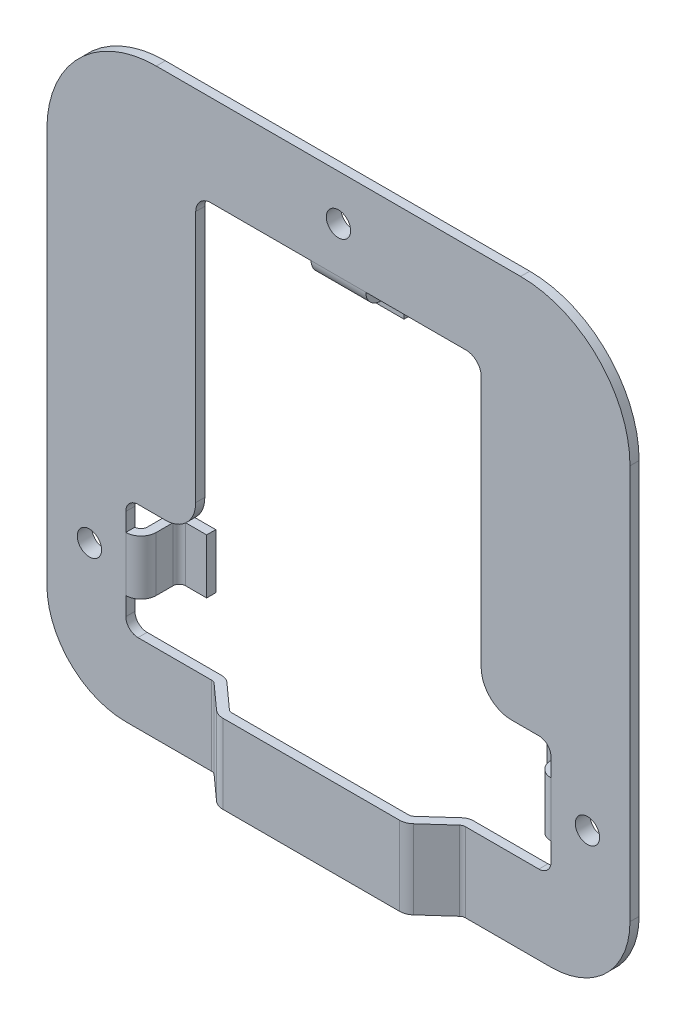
ISO-10303-21;
HEADER;
FILE_DESCRIPTION(('STEP AP214'),'2;1');
FILE_NAME('part.step','',(''),(''),'','','');
FILE_SCHEMA(('AUTOMOTIVE_DESIGN { 1 0 10303 214 1 1 1 1 }'));
ENDSEC;
DATA;
#1=APPLICATION_CONTEXT('core data for automotive mechanical design processes');
#2=APPLICATION_PROTOCOL_DEFINITION('international standard','automotive_design',2000,#1);
#3=PRODUCT_CONTEXT('',#1,'mechanical');
#4=PRODUCT('Part','Part','',(#3));
#5=PRODUCT_RELATED_PRODUCT_CATEGORY('part','',(#4));
#6=PRODUCT_DEFINITION_FORMATION('','',#4);
#7=PRODUCT_DEFINITION_CONTEXT('part definition',#1,'design');
#8=PRODUCT_DEFINITION('design','',#6,#7);
#9=PRODUCT_DEFINITION_SHAPE('','',#8);
#10=(LENGTH_UNIT() NAMED_UNIT(*) SI_UNIT(.MILLI.,.METRE.));
#11=(NAMED_UNIT(*) PLANE_ANGLE_UNIT() SI_UNIT($,.RADIAN.));
#12=(NAMED_UNIT(*) SI_UNIT($,.STERADIAN.) SOLID_ANGLE_UNIT());
#13=UNCERTAINTY_MEASURE_WITH_UNIT(LENGTH_MEASURE(1.E-05),#10,'distance_accuracy_value','');
#14=(GEOMETRIC_REPRESENTATION_CONTEXT(3) GLOBAL_UNCERTAINTY_ASSIGNED_CONTEXT((#13)) GLOBAL_UNIT_ASSIGNED_CONTEXT((#10,
#11,#12)) REPRESENTATION_CONTEXT('',''));
#15=CARTESIAN_POINT('',(0.,0.,0.));
#16=DIRECTION('',(0.,0.,1.));
#17=DIRECTION('',(1.,0.,0.));
#18=AXIS2_PLACEMENT_3D('',#15,#16,#17);
#19=CARTESIAN_POINT('',(83.,13.,-1.5));
#20=DIRECTION('',(0.,0.,-1.));
#21=DIRECTION('',(-1.,0.,0.));
#22=AXIS2_PLACEMENT_3D('',#19,#20,#21);
#23=PLANE('',#22);
#24=CARTESIAN_POINT('',(7.00000000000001,22.5,-1.5));
#25=DIRECTION('',(0.,0.,-1.));
#26=DIRECTION('',(-1.,0.,0.));
#27=AXIS2_PLACEMENT_3D('',#24,#25,#26);
#28=CIRCLE('',#27,2.6);
#29=CARTESIAN_POINT('',(4.40000000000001,22.5,-1.5));
#30=VERTEX_POINT('',#29);
#31=EDGE_CURVE('E1858',#30,#30,#28,.T.);
#32=ORIENTED_EDGE('',*,*,#31,.F.);
#33=EDGE_LOOP('',(#32));
#34=FACE_BOUND('',#33,.T.);
#35=DIRECTION('',(1.,0.,0.));
#36=VECTOR('',#35,1.);
#37=CARTESIAN_POINT('',(83.,81.,-1.5));
#38=LINE('',#37,#36);
#39=CARTESIAN_POINT('',(52.5,81.,-1.5));
#40=VERTEX_POINT('',#39);
#41=CARTESIAN_POINT('',(69.,81.,-1.5));
#42=VERTEX_POINT('',#41);
#43=EDGE_CURVE('E489',#40,#42,#38,.T.);
#44=ORIENTED_EDGE('',*,*,#43,.F.);
#45=DIRECTION('',(-1.,0.,0.));
#46=VECTOR('',#45,1.);
#47=CARTESIAN_POINT('',(43.5,81.,-1.5));
#48=LINE('',#47,#46);
#49=CARTESIAN_POINT('',(43.5,81.,-1.5));
#50=VERTEX_POINT('',#49);
#51=EDGE_CURVE('E474',#40,#50,#48,.T.);
#52=ORIENTED_EDGE('',*,*,#51,.T.);
#53=CARTESIAN_POINT('',(27.,81.,-1.5));
#54=VERTEX_POINT('',#53);
#55=EDGE_CURVE('E487',#54,#50,#38,.T.);
#56=ORIENTED_EDGE('',*,*,#55,.F.);
#57=CARTESIAN_POINT('',(27.,78.5,-1.5));
#58=DIRECTION('',(0.,0.,-1.));
#59=DIRECTION('',(-1.,0.,0.));
#60=AXIS2_PLACEMENT_3D('',#57,#58,#59);
#61=CIRCLE('',#60,2.5);
#62=CARTESIAN_POINT('',(24.5,78.5,-1.5));
#63=VERTEX_POINT('',#62);
#64=EDGE_CURVE('E500',#63,#54,#61,.T.);
#65=ORIENTED_EDGE('',*,*,#64,.F.);
#66=DIRECTION('',(0.,1.,0.));
#67=VECTOR('',#66,1.);
#68=CARTESIAN_POINT('',(24.5,13.,-1.5));
#69=LINE('',#68,#67);
#70=CARTESIAN_POINT('',(24.5,37.,-1.5));
#71=VERTEX_POINT('',#70);
#72=EDGE_CURVE('E868',#71,#63,#69,.T.);
#73=ORIENTED_EDGE('',*,*,#72,.F.);
#74=CARTESIAN_POINT('',(19.5,37.,-1.5));
#75=DIRECTION('',(0.,0.,-1.));
#76=DIRECTION('',(-1.,0.,0.));
#77=AXIS2_PLACEMENT_3D('',#74,#75,#76);
#78=CIRCLE('',#77,5.);
#79=CARTESIAN_POINT('',(19.5,32.,-1.5));
#80=VERTEX_POINT('',#79);
#81=EDGE_CURVE('E870',#80,#71,#78,.F.);
#82=ORIENTED_EDGE('',*,*,#81,.F.);
#83=DIRECTION('',(1.,0.,0.));
#84=VECTOR('',#83,1.);
#85=CARTESIAN_POINT('',(83.,32.,-1.5));
#86=LINE('',#85,#84);
#87=CARTESIAN_POINT('',(15.,32.,-1.5));
#88=VERTEX_POINT('',#87);
#89=EDGE_CURVE('E872',#88,#80,#86,.T.);
#90=ORIENTED_EDGE('',*,*,#89,.F.);
#91=CARTESIAN_POINT('',(15.,30.,-1.5));
#92=DIRECTION('',(0.,0.,-1.));
#93=DIRECTION('',(-1.,0.,0.));
#94=AXIS2_PLACEMENT_3D('',#91,#92,#93);
#95=CIRCLE('',#94,2.);
#96=CARTESIAN_POINT('',(13.,30.,-1.5));
#97=VERTEX_POINT('',#96);
#98=EDGE_CURVE('E874',#97,#88,#95,.T.);
#99=ORIENTED_EDGE('',*,*,#98,.F.);
#100=DIRECTION('',(0.,1.,0.));
#101=VECTOR('',#100,1.);
#102=CARTESIAN_POINT('',(13.,13.,-1.5));
#103=LINE('',#102,#101);
#104=CARTESIAN_POINT('',(13.,27.,-1.5));
#105=VERTEX_POINT('',#104);
#106=EDGE_CURVE('E876',#105,#97,#103,.T.);
#107=ORIENTED_EDGE('',*,*,#106,.F.);
#108=DIRECTION('',(0.,1.,0.));
#109=VECTOR('',#108,1.);
#110=CARTESIAN_POINT('',(13.,18.,-1.5));
#111=LINE('',#110,#109);
#112=CARTESIAN_POINT('',(13.,18.,-1.49999999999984));
#113=VERTEX_POINT('',#112);
#114=EDGE_CURVE('E490',#105,#113,#111,.F.);
#115=ORIENTED_EDGE('',*,*,#114,.T.);
#116=CARTESIAN_POINT('',(13.,15.,-1.5));
#117=VERTEX_POINT('',#116);
#118=EDGE_CURVE('E877',#117,#113,#103,.T.);
#119=ORIENTED_EDGE('',*,*,#118,.F.);
#120=CARTESIAN_POINT('',(15.,15.,-1.5));
#121=DIRECTION('',(0.,0.,-1.));
#122=DIRECTION('',(-1.,0.,0.));
#123=AXIS2_PLACEMENT_3D('',#120,#121,#122);
#124=CIRCLE('',#123,2.);
#125=CARTESIAN_POINT('',(15.,13.,-1.5));
#126=VERTEX_POINT('',#125);
#127=EDGE_CURVE('E880',#126,#117,#124,.T.);
#128=ORIENTED_EDGE('',*,*,#127,.F.);
#129=DIRECTION('',(-1.,0.,0.));
#130=VECTOR('',#129,1.);
#131=CARTESIAN_POINT('',(83.,13.,-1.5));
#132=LINE('',#131,#130);
#133=CARTESIAN_POINT('',(27.3081319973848,13.,-1.5));
#134=VERTEX_POINT('',#133);
#135=EDGE_CURVE('E882',#134,#126,#132,.T.);
#136=ORIENTED_EDGE('',*,*,#135,.F.);
#137=DIRECTION('',(0.,-1.,0.));
#138=VECTOR('',#137,1.);
#139=CARTESIAN_POINT('',(27.3081319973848,13.,-1.5));
#140=LINE('',#139,#138);
#141=CARTESIAN_POINT('',(27.3081319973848,0.,-1.5));
#142=VERTEX_POINT('',#141);
#143=EDGE_CURVE('E953',#134,#142,#140,.T.);
#144=ORIENTED_EDGE('',*,*,#143,.T.);
#145=DIRECTION('',(1.,0.,0.));
#146=VECTOR('',#145,1.);
#147=CARTESIAN_POINT('',(13.,0.,-1.5));
#148=LINE('',#147,#146);
#149=CARTESIAN_POINT('',(13.,0.,-1.5));
#150=VERTEX_POINT('',#149);
#151=EDGE_CURVE('E908',#150,#142,#148,.T.);
#152=ORIENTED_EDGE('',*,*,#151,.F.);
#153=CARTESIAN_POINT('',(13.,13.,-1.5));
#154=DIRECTION('',(0.,0.,1.));
#155=DIRECTION('',(1.,0.,0.));
#156=AXIS2_PLACEMENT_3D('',#153,#154,#155);
#157=CIRCLE('',#156,13.);
#158=CARTESIAN_POINT('',(0.,13.,-1.5));
#159=VERTEX_POINT('',#158);
#160=EDGE_CURVE('E904',#159,#150,#157,.T.);
#161=ORIENTED_EDGE('',*,*,#160,.F.);
#162=DIRECTION('',(0.,-1.,0.));
#163=VECTOR('',#162,1.);
#164=CARTESIAN_POINT('',(0.,13.,-1.5));
#165=LINE('',#164,#163);
#166=CARTESIAN_POINT('',(0.,78.,-1.5));
#167=VERTEX_POINT('',#166);
#168=EDGE_CURVE('E901',#167,#159,#165,.T.);
#169=ORIENTED_EDGE('',*,*,#168,.F.);
#170=CARTESIAN_POINT('',(18.,78.,-1.5));
#171=DIRECTION('',(0.,0.,1.));
#172=DIRECTION('',(1.,0.,0.));
#173=AXIS2_PLACEMENT_3D('',#170,#171,#172);
#174=CIRCLE('',#173,18.);
#175=CARTESIAN_POINT('',(18.,96.,-1.5));
#176=VERTEX_POINT('',#175);
#177=EDGE_CURVE('E898',#176,#167,#174,.T.);
#178=ORIENTED_EDGE('',*,*,#177,.F.);
#179=DIRECTION('',(-1.,0.,0.));
#180=VECTOR('',#179,1.);
#181=CARTESIAN_POINT('',(18.,96.,-1.5));
#182=LINE('',#181,#180);
#183=CARTESIAN_POINT('',(78.,96.,-1.5));
#184=VERTEX_POINT('',#183);
#185=EDGE_CURVE('E895',#184,#176,#182,.T.);
#186=ORIENTED_EDGE('',*,*,#185,.F.);
#187=CARTESIAN_POINT('',(78.,78.,-1.5));
#188=DIRECTION('',(0.,0.,1.));
#189=DIRECTION('',(1.,0.,0.));
#190=AXIS2_PLACEMENT_3D('',#187,#188,#189);
#191=CIRCLE('',#190,18.);
#192=CARTESIAN_POINT('',(96.,78.,-1.5));
#193=VERTEX_POINT('',#192);
#194=EDGE_CURVE('E892',#193,#184,#191,.T.);
#195=ORIENTED_EDGE('',*,*,#194,.F.);
#196=DIRECTION('',(0.,1.,0.));
#197=VECTOR('',#196,1.);
#198=CARTESIAN_POINT('',(96.,13.,-1.5));
#199=LINE('',#198,#197);
#200=CARTESIAN_POINT('',(96.,13.,-1.5));
#201=VERTEX_POINT('',#200);
#202=EDGE_CURVE('E888',#201,#193,#199,.T.);
#203=ORIENTED_EDGE('',*,*,#202,.F.);
#204=CARTESIAN_POINT('',(83.,13.,-1.5));
#205=DIRECTION('',(0.,0.,1.));
#206=DIRECTION('',(-1.,0.,0.));
#207=AXIS2_PLACEMENT_3D('',#204,#205,#206);
#208=CIRCLE('',#207,13.);
#209=CARTESIAN_POINT('',(83.,0.,-1.5));
#210=VERTEX_POINT('',#209);
#211=EDGE_CURVE('E885',#210,#201,#208,.T.);
#212=ORIENTED_EDGE('',*,*,#211,.F.);
#213=CARTESIAN_POINT('',(68.6918680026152,0.,-1.5));
#214=VERTEX_POINT('',#213);
#215=EDGE_CURVE('E907',#214,#210,#148,.T.);
#216=ORIENTED_EDGE('',*,*,#215,.F.);
#217=DIRECTION('',(0.,-1.,0.));
#218=VECTOR('',#217,1.);
#219=CARTESIAN_POINT('',(68.6918680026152,13.,-1.5));
#220=LINE('',#219,#218);
#221=CARTESIAN_POINT('',(68.6918680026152,13.,-1.5));
#222=VERTEX_POINT('',#221);
#223=EDGE_CURVE('E938',#214,#222,#220,.F.);
#224=ORIENTED_EDGE('',*,*,#223,.T.);
#225=DIRECTION('',(-1.,0.,0.));
#226=VECTOR('',#225,1.);
#227=CARTESIAN_POINT('',(83.,13.,-1.5));
#228=LINE('',#227,#226);
#229=CARTESIAN_POINT('',(81.,13.,-1.5));
#230=VERTEX_POINT('',#229);
#231=EDGE_CURVE('E817',#230,#222,#228,.T.);
#232=ORIENTED_EDGE('',*,*,#231,.F.);
#233=CARTESIAN_POINT('',(81.,15.,-1.5));
#234=DIRECTION('',(0.,0.,-1.));
#235=DIRECTION('',(-1.,0.,0.));
#236=AXIS2_PLACEMENT_3D('',#233,#234,#235);
#237=CIRCLE('',#236,2.);
#238=CARTESIAN_POINT('',(83.,15.,-1.5));
#239=VERTEX_POINT('',#238);
#240=EDGE_CURVE('E851',#239,#230,#237,.T.);
#241=ORIENTED_EDGE('',*,*,#240,.F.);
#242=DIRECTION('',(0.,-1.,0.));
#243=VECTOR('',#242,1.);
#244=CARTESIAN_POINT('',(83.,13.,-1.5));
#245=LINE('',#244,#243);
#246=CARTESIAN_POINT('',(83.,18.,-1.5));
#247=VERTEX_POINT('',#246);
#248=EDGE_CURVE('E853',#247,#239,#245,.T.);
#249=ORIENTED_EDGE('',*,*,#248,.F.);
#250=DIRECTION('',(0.,1.,0.));
#251=VECTOR('',#250,1.);
#252=CARTESIAN_POINT('',(83.,27.,-1.5));
#253=LINE('',#252,#251);
#254=CARTESIAN_POINT('',(83.,27.,-1.5));
#255=VERTEX_POINT('',#254);
#256=EDGE_CURVE('E1013',#247,#255,#253,.T.);
#257=ORIENTED_EDGE('',*,*,#256,.T.);
#258=CARTESIAN_POINT('',(83.,30.,-1.5));
#259=VERTEX_POINT('',#258);
#260=EDGE_CURVE('E854',#259,#255,#245,.T.);
#261=ORIENTED_EDGE('',*,*,#260,.F.);
#262=CARTESIAN_POINT('',(81.,30.,-1.5));
#263=DIRECTION('',(0.,0.,-1.));
#264=DIRECTION('',(-1.,0.,0.));
#265=AXIS2_PLACEMENT_3D('',#262,#263,#264);
#266=CIRCLE('',#265,2.);
#267=CARTESIAN_POINT('',(81.,32.,-1.5));
#268=VERTEX_POINT('',#267);
#269=EDGE_CURVE('E857',#268,#259,#266,.T.);
#270=ORIENTED_EDGE('',*,*,#269,.F.);
#271=DIRECTION('',(1.,0.,0.));
#272=VECTOR('',#271,1.);
#273=CARTESIAN_POINT('',(83.,32.,-1.5));
#274=LINE('',#273,#272);
#275=CARTESIAN_POINT('',(76.5,32.,-1.5));
#276=VERTEX_POINT('',#275);
#277=EDGE_CURVE('E859',#276,#268,#274,.T.);
#278=ORIENTED_EDGE('',*,*,#277,.F.);
#279=CARTESIAN_POINT('',(76.5,37.,-1.5));
#280=DIRECTION('',(0.,0.,-1.));
#281=DIRECTION('',(-1.,0.,0.));
#282=AXIS2_PLACEMENT_3D('',#279,#280,#281);
#283=CIRCLE('',#282,5.);
#284=CARTESIAN_POINT('',(71.5,37.,-1.5));
#285=VERTEX_POINT('',#284);
#286=EDGE_CURVE('E861',#285,#276,#283,.F.);
#287=ORIENTED_EDGE('',*,*,#286,.F.);
#288=DIRECTION('',(0.,-1.,0.));
#289=VECTOR('',#288,1.);
#290=CARTESIAN_POINT('',(71.5,13.,-1.5));
#291=LINE('',#290,#289);
#292=CARTESIAN_POINT('',(71.5,78.5,-1.5));
#293=VERTEX_POINT('',#292);
#294=EDGE_CURVE('E863',#293,#285,#291,.T.);
#295=ORIENTED_EDGE('',*,*,#294,.F.);
#296=CARTESIAN_POINT('',(69.,78.5,-1.5));
#297=DIRECTION('',(0.,0.,-1.));
#298=DIRECTION('',(-1.,0.,0.));
#299=AXIS2_PLACEMENT_3D('',#296,#297,#298);
#300=CIRCLE('',#299,2.5);
#301=EDGE_CURVE('E865',#42,#293,#300,.T.);
#302=ORIENTED_EDGE('',*,*,#301,.F.);
#303=EDGE_LOOP('',(#44,#52,#56,#65,#73,#82,#90,#99,#107,#115,#119,#128,#136,#144,#152,#161,#169,
#178,#186,#195,#203,#212,#216,#224,#232,#241,#249,#257,#261,#270,#278,#287,#295,#302));
#304=FACE_BOUND('',#303,.T.);
#305=CARTESIAN_POINT('',(48.,88.5,-1.5));
#306=DIRECTION('',(0.,0.,-1.));
#307=DIRECTION('',(-1.,0.,0.));
#308=AXIS2_PLACEMENT_3D('',#305,#306,#307);
#309=CIRCLE('',#308,2.6);
#310=CARTESIAN_POINT('',(45.4,88.5,-1.5));
#311=VERTEX_POINT('',#310);
#312=EDGE_CURVE('E511',#311,#311,#309,.T.);
#313=ORIENTED_EDGE('',*,*,#312,.F.);
#314=EDGE_LOOP('',(#313));
#315=FACE_BOUND('',#314,.T.);
#316=CARTESIAN_POINT('',(89.,22.5,-1.5));
#317=DIRECTION('',(0.,0.,-1.));
#318=DIRECTION('',(-1.,0.,0.));
#319=AXIS2_PLACEMENT_3D('',#316,#317,#318);
#320=CIRCLE('',#319,2.6);
#321=CARTESIAN_POINT('',(86.4,22.5,-1.5));
#322=VERTEX_POINT('',#321);
#323=EDGE_CURVE('E1847',#322,#322,#320,.T.);
#324=ORIENTED_EDGE('',*,*,#323,.F.);
#325=EDGE_LOOP('',(#324));
#326=FACE_BOUND('',#325,.T.);
#327=ADVANCED_FACE('F35',(#34,#304,#315,#326),#23,.T.);
#328=CARTESIAN_POINT('',(27.,81.,-2.));
#329=DIRECTION('',(0.,1.,0.));
#330=DIRECTION('',(0.,0.,1.));
#331=AXIS2_PLACEMENT_3D('',#328,#329,#330);
#332=PLANE('',#331);
#333=DIRECTION('',(0.,0.,-1.));
#334=VECTOR('',#333,1.);
#335=CARTESIAN_POINT('',(43.5,81.,0.));
#336=LINE('',#335,#334);
#337=CARTESIAN_POINT('',(43.5,81.,0.));
#338=VERTEX_POINT('',#337);
#339=EDGE_CURVE('E496',#338,#50,#336,.T.);
#340=ORIENTED_EDGE('',*,*,#339,.F.);
#341=DIRECTION('',(-1.,0.,0.));
#342=VECTOR('',#341,1.);
#343=CARTESIAN_POINT('',(27.,81.,0.));
#344=LINE('',#343,#342);
#345=CARTESIAN_POINT('',(27.,81.,0.));
#346=VERTEX_POINT('',#345);
#347=EDGE_CURVE('E785',#338,#346,#344,.T.);
#348=ORIENTED_EDGE('',*,*,#347,.T.);
#349=DIRECTION('',(0.,0.,1.));
#350=VECTOR('',#349,1.);
#351=CARTESIAN_POINT('',(27.,81.,-2.));
#352=LINE('',#351,#350);
#353=EDGE_CURVE('E499',#54,#346,#352,.T.);
#354=ORIENTED_EDGE('',*,*,#353,.F.);
#355=ORIENTED_EDGE('',*,*,#55,.T.);
#356=EDGE_LOOP('',(#340,#348,#354,#355));
#357=FACE_BOUND('',#356,.T.);
#358=ADVANCED_FACE('F495',(#357),#332,.F.);
#359=CARTESIAN_POINT('',(13.,15.,-2.));
#360=DIRECTION('',(-1.,0.,0.));
#361=DIRECTION('',(0.,0.,1.));
#362=AXIS2_PLACEMENT_3D('',#359,#360,#361);
#363=PLANE('',#362);
#364=DIRECTION('',(0.,0.,1.));
#365=VECTOR('',#364,1.);
#366=CARTESIAN_POINT('',(13.,18.,0.));
#367=LINE('',#366,#365);
#368=CARTESIAN_POINT('',(13.,18.,0.));
#369=VERTEX_POINT('',#368);
#370=EDGE_CURVE('E610',#113,#369,#367,.T.);
#371=ORIENTED_EDGE('',*,*,#370,.T.);
#372=DIRECTION('',(0.,-1.,0.));
#373=VECTOR('',#372,1.);
#374=CARTESIAN_POINT('',(13.,15.,0.));
#375=LINE('',#374,#373);
#376=CARTESIAN_POINT('',(13.,15.,0.));
#377=VERTEX_POINT('',#376);
#378=EDGE_CURVE('E804',#369,#377,#375,.T.);
#379=ORIENTED_EDGE('',*,*,#378,.T.);
#380=DIRECTION('',(0.,0.,1.));
#381=VECTOR('',#380,1.);
#382=CARTESIAN_POINT('',(13.,15.,-2.));
#383=LINE('',#382,#381);
#384=EDGE_CURVE('E818',#117,#377,#383,.T.);
#385=ORIENTED_EDGE('',*,*,#384,.F.);
#386=ORIENTED_EDGE('',*,*,#118,.T.);
#387=EDGE_LOOP('',(#371,#379,#385,#386));
#388=FACE_BOUND('',#387,.T.);
#389=ADVANCED_FACE('F1108',(#388),#363,.F.);
#390=CARTESIAN_POINT('',(83.,15.,-2.));
#391=DIRECTION('',(1.,0.,0.));
#392=DIRECTION('',(0.,0.,-1.));
#393=AXIS2_PLACEMENT_3D('',#390,#391,#392);
#394=PLANE('',#393);
#395=DIRECTION('',(0.,0.,-1.));
#396=VECTOR('',#395,1.);
#397=CARTESIAN_POINT('',(83.,27.,0.));
#398=LINE('',#397,#396);
#399=CARTESIAN_POINT('',(83.,27.,0.));
#400=VERTEX_POINT('',#399);
#401=EDGE_CURVE('E616',#400,#255,#398,.T.);
#402=ORIENTED_EDGE('',*,*,#401,.F.);
#403=DIRECTION('',(0.,1.,0.));
#404=VECTOR('',#403,1.);
#405=CARTESIAN_POINT('',(83.,15.,0.));
#406=LINE('',#405,#404);
#407=CARTESIAN_POINT('',(83.,30.,0.));
#408=VERTEX_POINT('',#407);
#409=EDGE_CURVE('E766',#400,#408,#406,.T.);
#410=ORIENTED_EDGE('',*,*,#409,.T.);
#411=DIRECTION('',(0.,0.,1.));
#412=VECTOR('',#411,1.);
#413=CARTESIAN_POINT('',(83.,30.,-2.));
#414=LINE('',#413,#412);
#415=EDGE_CURVE('E842',#259,#408,#414,.T.);
#416=ORIENTED_EDGE('',*,*,#415,.F.);
#417=ORIENTED_EDGE('',*,*,#260,.T.);
#418=EDGE_LOOP('',(#402,#410,#416,#417));
#419=FACE_BOUND('',#418,.T.);
#420=ADVANCED_FACE('F1151',(#419),#394,.F.);
#421=CARTESIAN_POINT('',(83.,13.,-1.5));
#422=DIRECTION('',(0.,0.,1.));
#423=DIRECTION('',(1.,0.,0.));
#424=AXIS2_PLACEMENT_3D('',#421,#422,#423);
#425=CYLINDRICAL_SURFACE('',#424,13.);
#426=CARTESIAN_POINT('',(83.,13.,0.));
#427=DIRECTION('',(0.,0.,1.));
#428=DIRECTION('',(-1.,0.,0.));
#429=AXIS2_PLACEMENT_3D('',#426,#427,#428);
#430=CIRCLE('',#429,13.);
#431=CARTESIAN_POINT('',(83.,0.,0.));
#432=VERTEX_POINT('',#431);
#433=CARTESIAN_POINT('',(96.,13.,0.));
#434=VERTEX_POINT('',#433);
#435=EDGE_CURVE('E884',#432,#434,#430,.T.);
#436=ORIENTED_EDGE('',*,*,#435,.F.);
#437=DIRECTION('',(0.,0.,1.));
#438=VECTOR('',#437,1.);
#439=CARTESIAN_POINT('',(83.,0.,-1.5));
#440=LINE('',#439,#438);
#441=EDGE_CURVE('E935',#210,#432,#440,.T.);
#442=ORIENTED_EDGE('',*,*,#441,.F.);
#443=ORIENTED_EDGE('',*,*,#211,.T.);
#444=DIRECTION('',(0.,0.,1.));
#445=VECTOR('',#444,1.);
#446=CARTESIAN_POINT('',(96.,13.,-1.5));
#447=LINE('',#446,#445);
#448=EDGE_CURVE('E911',#201,#434,#447,.T.);
#449=ORIENTED_EDGE('',*,*,#448,.T.);
#450=EDGE_LOOP('',(#436,#442,#443,#449));
#451=FACE_BOUND('',#450,.T.);
#452=ADVANCED_FACE('F1125',(#451),#425,.T.);
#453=CARTESIAN_POINT('',(13.,0.,-1.5));
#454=DIRECTION('',(0.,-1.,0.));
#455=DIRECTION('',(0.,0.,-1.));
#456=AXIS2_PLACEMENT_3D('',#453,#454,#455);
#457=PLANE('',#456);
#458=ORIENTED_EDGE('',*,*,#151,.T.);
#459=CARTESIAN_POINT('',(27.3081319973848,0.,0.5));
#460=DIRECTION('',(0.,-1.,0.));
#461=DIRECTION('',(0.,0.,-1.));
#462=AXIS2_PLACEMENT_3D('',#459,#460,#461);
#463=CIRCLE('',#462,2.);
#464=CARTESIAN_POINT('',(28.6460614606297,0.,-0.986588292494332));
#465=VERTEX_POINT('',#464);
#466=EDGE_CURVE('E958',#142,#465,#463,.T.);
#467=ORIENTED_EDGE('',*,*,#466,.T.);
#468=DIRECTION('',(0.743294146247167,0.,0.668964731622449));
#469=VECTOR('',#468,1.);
#470=CARTESIAN_POINT('',(32.7903752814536,0.,2.74329414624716));
#471=LINE('',#470,#469);
#472=CARTESIAN_POINT('',(32.7903752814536,0.,2.74329414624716));
#473=VERTEX_POINT('',#472);
#474=EDGE_CURVE('E712',#465,#473,#471,.T.);
#475=ORIENTED_EDGE('',*,*,#474,.T.);
#476=CARTESIAN_POINT('',(33.459340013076,0.,2.));
#477=DIRECTION('',(0.,1.,0.));
#478=DIRECTION('',(0.,0.,1.));
#479=AXIS2_PLACEMENT_3D('',#476,#477,#478);
#480=CIRCLE('',#479,1.);
#481=CARTESIAN_POINT('',(33.4593400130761,0.,3.));
#482=VERTEX_POINT('',#481);
#483=EDGE_CURVE('E714',#473,#482,#480,.T.);
#484=ORIENTED_EDGE('',*,*,#483,.T.);
#485=DIRECTION('',(1.,0.,0.));
#486=VECTOR('',#485,1.);
#487=CARTESIAN_POINT('',(62.540659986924,0.,3.));
#488=LINE('',#487,#486);
#489=CARTESIAN_POINT('',(62.540659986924,0.,3.));
#490=VERTEX_POINT('',#489);
#491=EDGE_CURVE('E717',#482,#490,#488,.T.);
#492=ORIENTED_EDGE('',*,*,#491,.T.);
#493=CARTESIAN_POINT('',(62.540659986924,0.,2.));
#494=DIRECTION('',(0.,1.,0.));
#495=DIRECTION('',(0.,0.,-1.));
#496=AXIS2_PLACEMENT_3D('',#493,#494,#495);
#497=CIRCLE('',#496,0.999999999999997);
#498=CARTESIAN_POINT('',(63.2096247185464,0.,2.74329414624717));
#499=VERTEX_POINT('',#498);
#500=EDGE_CURVE('E720',#490,#499,#497,.T.);
#501=ORIENTED_EDGE('',*,*,#500,.T.);
#502=DIRECTION('',(0.743294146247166,0.,-0.668964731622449));
#503=VECTOR('',#502,1.);
#504=CARTESIAN_POINT('',(63.2096247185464,0.,2.74329414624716));
#505=LINE('',#504,#503);
#506=CARTESIAN_POINT('',(67.3539385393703,0.,-0.986588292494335));
#507=VERTEX_POINT('',#506);
#508=EDGE_CURVE('E723',#499,#507,#505,.T.);
#509=ORIENTED_EDGE('',*,*,#508,.T.);
#510=CARTESIAN_POINT('',(68.6918680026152,0.,0.5));
#511=DIRECTION('',(0.,-1.,0.));
#512=DIRECTION('',(0.,0.,-1.));
#513=AXIS2_PLACEMENT_3D('',#510,#511,#512);
#514=CIRCLE('',#513,2.);
#515=EDGE_CURVE('E956',#507,#214,#514,.T.);
#516=ORIENTED_EDGE('',*,*,#515,.T.);
#517=ORIENTED_EDGE('',*,*,#215,.T.);
#518=ORIENTED_EDGE('',*,*,#441,.T.);
#519=DIRECTION('',(1.,0.,0.));
#520=VECTOR('',#519,1.);
#521=CARTESIAN_POINT('',(13.,0.,0.));
#522=LINE('',#521,#520);
#523=CARTESIAN_POINT('',(68.8837360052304,0.,0.));
#524=VERTEX_POINT('',#523);
#525=EDGE_CURVE('E932',#524,#432,#522,.T.);
#526=ORIENTED_EDGE('',*,*,#525,.F.);
#527=CARTESIAN_POINT('',(68.8837360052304,0.,1.));
#528=DIRECTION('',(0.,-1.,0.));
#529=DIRECTION('',(0.,0.,-1.));
#530=AXIS2_PLACEMENT_3D('',#527,#528,#529);
#531=CIRCLE('',#530,1.);
#532=CARTESIAN_POINT('',(68.214771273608,0.,0.256705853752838));
#533=VERTEX_POINT('',#532);
#534=EDGE_CURVE('E985',#524,#533,#531,.F.);
#535=ORIENTED_EDGE('',*,*,#534,.T.);
#536=DIRECTION('',(-0.743294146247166,0.,0.66896473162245));
#537=VECTOR('',#536,1.);
#538=CARTESIAN_POINT('',(64.2130718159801,0.,3.85823536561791));
#539=LINE('',#538,#537);
#540=CARTESIAN_POINT('',(64.2130718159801,0.,3.85823536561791));
#541=VERTEX_POINT('',#540);
#542=EDGE_CURVE('E726',#533,#541,#539,.T.);
#543=ORIENTED_EDGE('',*,*,#542,.T.);
#544=CARTESIAN_POINT('',(62.540659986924,0.,2.));
#545=DIRECTION('',(0.,-1.,0.));
#546=DIRECTION('',(0.,0.,-1.));
#547=AXIS2_PLACEMENT_3D('',#544,#545,#546);
#548=CIRCLE('',#547,2.5);
#549=CARTESIAN_POINT('',(62.540659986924,0.,4.5));
#550=VERTEX_POINT('',#549);
#551=EDGE_CURVE('E728',#541,#550,#548,.T.);
#552=ORIENTED_EDGE('',*,*,#551,.T.);
#553=DIRECTION('',(-1.,0.,0.));
#554=VECTOR('',#553,1.);
#555=CARTESIAN_POINT('',(62.540659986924,0.,4.5));
#556=LINE('',#555,#554);
#557=CARTESIAN_POINT('',(33.4593400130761,0.,4.5));
#558=VERTEX_POINT('',#557);
#559=EDGE_CURVE('E731',#550,#558,#556,.T.);
#560=ORIENTED_EDGE('',*,*,#559,.T.);
#561=CARTESIAN_POINT('',(33.459340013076,0.,2.));
#562=DIRECTION('',(0.,-1.,0.));
#563=DIRECTION('',(0.,0.,1.));
#564=AXIS2_PLACEMENT_3D('',#561,#562,#563);
#565=CIRCLE('',#564,2.5);
#566=CARTESIAN_POINT('',(31.7869281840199,0.,3.85823536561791));
#567=VERTEX_POINT('',#566);
#568=EDGE_CURVE('E674',#558,#567,#565,.T.);
#569=ORIENTED_EDGE('',*,*,#568,.T.);
#570=DIRECTION('',(-0.743294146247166,0.,-0.66896473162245));
#571=VECTOR('',#570,1.);
#572=CARTESIAN_POINT('',(31.7869281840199,0.,3.85823536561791));
#573=LINE('',#572,#571);
#574=CARTESIAN_POINT('',(27.7852287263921,0.,0.256705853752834));
#575=VERTEX_POINT('',#574);
#576=EDGE_CURVE('E709',#567,#575,#573,.T.);
#577=ORIENTED_EDGE('',*,*,#576,.T.);
#578=CARTESIAN_POINT('',(27.1162639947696,0.,1.));
#579=DIRECTION('',(0.,-1.,0.));
#580=DIRECTION('',(0.,0.,-1.));
#581=AXIS2_PLACEMENT_3D('',#578,#579,#580);
#582=CIRCLE('',#581,1.);
#583=CARTESIAN_POINT('',(27.1162639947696,0.,0.));
#584=VERTEX_POINT('',#583);
#585=EDGE_CURVE('E979',#575,#584,#582,.F.);
#586=ORIENTED_EDGE('',*,*,#585,.T.);
#587=CARTESIAN_POINT('',(13.,0.,0.));
#588=VERTEX_POINT('',#587);
#589=EDGE_CURVE('E889',#588,#584,#522,.T.);
#590=ORIENTED_EDGE('',*,*,#589,.F.);
#591=DIRECTION('',(0.,0.,1.));
#592=VECTOR('',#591,1.);
#593=CARTESIAN_POINT('',(13.,0.,-1.5));
#594=LINE('',#593,#592);
#595=EDGE_CURVE('E939',#150,#588,#594,.T.);
#596=ORIENTED_EDGE('',*,*,#595,.F.);
#597=EDGE_LOOP('',(#458,#467,#475,#484,#492,#501,#509,#516,#517,#518,#526,#535,#543,#552,#560,
#569,#577,#586,#590,#596));
#598=FACE_BOUND('',#597,.T.);
#599=ADVANCED_FACE('F1121',(#598),#457,.T.);
#600=CARTESIAN_POINT('',(13.,13.,-1.5));
#601=DIRECTION('',(0.,0.,1.));
#602=DIRECTION('',(1.,0.,0.));
#603=AXIS2_PLACEMENT_3D('',#600,#601,#602);
#604=CYLINDRICAL_SURFACE('',#603,13.);
#605=CARTESIAN_POINT('',(13.,13.,0.));
#606=DIRECTION('',(0.,0.,1.));
#607=DIRECTION('',(1.,0.,0.));
#608=AXIS2_PLACEMENT_3D('',#605,#606,#607);
#609=CIRCLE('',#608,13.);
#610=CARTESIAN_POINT('',(0.,13.,0.));
#611=VERTEX_POINT('',#610);
#612=EDGE_CURVE('E929',#611,#588,#609,.T.);
#613=ORIENTED_EDGE('',*,*,#612,.F.);
#614=DIRECTION('',(0.,0.,1.));
#615=VECTOR('',#614,1.);
#616=CARTESIAN_POINT('',(0.,13.,-1.5));
#617=LINE('',#616,#615);
#618=EDGE_CURVE('E941',#159,#611,#617,.T.);
#619=ORIENTED_EDGE('',*,*,#618,.F.);
#620=ORIENTED_EDGE('',*,*,#160,.T.);
#621=ORIENTED_EDGE('',*,*,#595,.T.);
#622=EDGE_LOOP('',(#613,#619,#620,#621));
#623=FACE_BOUND('',#622,.T.);
#624=ADVANCED_FACE('F1124',(#623),#604,.T.);
#625=CARTESIAN_POINT('',(0.,13.,-1.5));
#626=DIRECTION('',(-1.,0.,0.));
#627=DIRECTION('',(0.,0.,1.));
#628=AXIS2_PLACEMENT_3D('',#625,#626,#627);
#629=PLANE('',#628);
#630=DIRECTION('',(0.,-1.,0.));
#631=VECTOR('',#630,1.);
#632=CARTESIAN_POINT('',(0.,13.,0.));
#633=LINE('',#632,#631);
#634=CARTESIAN_POINT('',(0.,78.,0.));
#635=VERTEX_POINT('',#634);
#636=EDGE_CURVE('E926',#635,#611,#633,.T.);
#637=ORIENTED_EDGE('',*,*,#636,.F.);
#638=DIRECTION('',(0.,0.,1.));
#639=VECTOR('',#638,1.);
#640=CARTESIAN_POINT('',(0.,78.,-1.5));
#641=LINE('',#640,#639);
#642=EDGE_CURVE('E943',#167,#635,#641,.T.);
#643=ORIENTED_EDGE('',*,*,#642,.F.);
#644=ORIENTED_EDGE('',*,*,#168,.T.);
#645=ORIENTED_EDGE('',*,*,#618,.T.);
#646=EDGE_LOOP('',(#637,#643,#644,#645));
#647=FACE_BOUND('',#646,.T.);
#648=ADVANCED_FACE('F1129',(#647),#629,.T.);
#649=CARTESIAN_POINT('',(18.,78.,-1.5));
#650=DIRECTION('',(0.,0.,1.));
#651=DIRECTION('',(1.,0.,0.));
#652=AXIS2_PLACEMENT_3D('',#649,#650,#651);
#653=CYLINDRICAL_SURFACE('',#652,18.);
#654=CARTESIAN_POINT('',(18.,78.,0.));
#655=DIRECTION('',(0.,0.,1.));
#656=DIRECTION('',(1.,0.,0.));
#657=AXIS2_PLACEMENT_3D('',#654,#655,#656);
#658=CIRCLE('',#657,18.);
#659=CARTESIAN_POINT('',(18.,96.,0.));
#660=VERTEX_POINT('',#659);
#661=EDGE_CURVE('E923',#660,#635,#658,.T.);
#662=ORIENTED_EDGE('',*,*,#661,.F.);
#663=DIRECTION('',(0.,0.,1.));
#664=VECTOR('',#663,1.);
#665=CARTESIAN_POINT('',(18.,96.,-1.5));
#666=LINE('',#665,#664);
#667=EDGE_CURVE('E945',#176,#660,#666,.T.);
#668=ORIENTED_EDGE('',*,*,#667,.F.);
#669=ORIENTED_EDGE('',*,*,#177,.T.);
#670=ORIENTED_EDGE('',*,*,#642,.T.);
#671=EDGE_LOOP('',(#662,#668,#669,#670));
#672=FACE_BOUND('',#671,.T.);
#673=ADVANCED_FACE('F1133',(#672),#653,.T.);
#674=CARTESIAN_POINT('',(18.,96.,-1.5));
#675=DIRECTION('',(0.,1.,0.));
#676=DIRECTION('',(0.,0.,1.));
#677=AXIS2_PLACEMENT_3D('',#674,#675,#676);
#678=PLANE('',#677);
#679=DIRECTION('',(-1.,0.,0.));
#680=VECTOR('',#679,1.);
#681=CARTESIAN_POINT('',(18.,96.,0.));
#682=LINE('',#681,#680);
#683=CARTESIAN_POINT('',(78.,96.,0.));
#684=VERTEX_POINT('',#683);
#685=EDGE_CURVE('E920',#684,#660,#682,.T.);
#686=ORIENTED_EDGE('',*,*,#685,.F.);
#687=DIRECTION('',(0.,0.,1.));
#688=VECTOR('',#687,1.);
#689=CARTESIAN_POINT('',(78.,96.,-1.5));
#690=LINE('',#689,#688);
#691=EDGE_CURVE('E947',#184,#684,#690,.T.);
#692=ORIENTED_EDGE('',*,*,#691,.F.);
#693=ORIENTED_EDGE('',*,*,#185,.T.);
#694=ORIENTED_EDGE('',*,*,#667,.T.);
#695=EDGE_LOOP('',(#686,#692,#693,#694));
#696=FACE_BOUND('',#695,.T.);
#697=ADVANCED_FACE('F1137',(#696),#678,.T.);
#698=CARTESIAN_POINT('',(78.,78.,-1.5));
#699=DIRECTION('',(0.,0.,1.));
#700=DIRECTION('',(1.,0.,0.));
#701=AXIS2_PLACEMENT_3D('',#698,#699,#700);
#702=CYLINDRICAL_SURFACE('',#701,18.);
#703=CARTESIAN_POINT('',(78.,78.,0.));
#704=DIRECTION('',(0.,0.,1.));
#705=DIRECTION('',(1.,0.,0.));
#706=AXIS2_PLACEMENT_3D('',#703,#704,#705);
#707=CIRCLE('',#706,18.);
#708=CARTESIAN_POINT('',(96.,78.,0.));
#709=VERTEX_POINT('',#708);
#710=EDGE_CURVE('E917',#709,#684,#707,.T.);
#711=ORIENTED_EDGE('',*,*,#710,.F.);
#712=DIRECTION('',(0.,0.,1.));
#713=VECTOR('',#712,1.);
#714=CARTESIAN_POINT('',(96.,78.,-1.5));
#715=LINE('',#714,#713);
#716=EDGE_CURVE('E949',#193,#709,#715,.T.);
#717=ORIENTED_EDGE('',*,*,#716,.F.);
#718=ORIENTED_EDGE('',*,*,#194,.T.);
#719=ORIENTED_EDGE('',*,*,#691,.T.);
#720=EDGE_LOOP('',(#711,#717,#718,#719));
#721=FACE_BOUND('',#720,.T.);
#722=ADVANCED_FACE('F1141',(#721),#702,.T.);
#723=CARTESIAN_POINT('',(96.,13.,-1.5));
#724=DIRECTION('',(1.,0.,0.));
#725=DIRECTION('',(0.,0.,-1.));
#726=AXIS2_PLACEMENT_3D('',#723,#724,#725);
#727=PLANE('',#726);
#728=DIRECTION('',(0.,1.,0.));
#729=VECTOR('',#728,1.);
#730=CARTESIAN_POINT('',(96.,13.,0.));
#731=LINE('',#730,#729);
#732=EDGE_CURVE('E914',#434,#709,#731,.T.);
#733=ORIENTED_EDGE('',*,*,#732,.F.);
#734=ORIENTED_EDGE('',*,*,#448,.F.);
#735=ORIENTED_EDGE('',*,*,#202,.T.);
#736=ORIENTED_EDGE('',*,*,#716,.T.);
#737=EDGE_LOOP('',(#733,#734,#735,#736));
#738=FACE_BOUND('',#737,.T.);
#739=ADVANCED_FACE('F1119',(#738),#727,.T.);
#740=CARTESIAN_POINT('',(83.,13.,0.));
#741=DIRECTION('',(0.,0.,-1.));
#742=DIRECTION('',(-1.,0.,0.));
#743=AXIS2_PLACEMENT_3D('',#740,#741,#742);
#744=PLANE('',#743);
#745=CARTESIAN_POINT('',(7.00000000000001,22.5,0.));
#746=DIRECTION('',(0.,0.,1.));
#747=DIRECTION('',(1.,0.,0.));
#748=AXIS2_PLACEMENT_3D('',#745,#746,#747);
#749=CIRCLE('',#748,2.);
#750=CARTESIAN_POINT('',(9.00000000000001,22.5,0.));
#751=VERTEX_POINT('',#750);
#752=EDGE_CURVE('E752',#751,#751,#749,.T.);
#753=ORIENTED_EDGE('',*,*,#752,.F.);
#754=EDGE_LOOP('',(#753));
#755=FACE_BOUND('',#754,.T.);
#756=CARTESIAN_POINT('',(89.,22.5,0.));
#757=DIRECTION('',(0.,0.,1.));
#758=DIRECTION('',(1.,0.,0.));
#759=AXIS2_PLACEMENT_3D('',#756,#757,#758);
#760=CIRCLE('',#759,2.);
#761=CARTESIAN_POINT('',(91.,22.5,0.));
#762=VERTEX_POINT('',#761);
#763=EDGE_CURVE('E755',#762,#762,#760,.T.);
#764=ORIENTED_EDGE('',*,*,#763,.F.);
#765=EDGE_LOOP('',(#764));
#766=FACE_BOUND('',#765,.T.);
#767=CARTESIAN_POINT('',(48.,88.5,0.));
#768=DIRECTION('',(0.,0.,1.));
#769=DIRECTION('',(1.,0.,0.));
#770=AXIS2_PLACEMENT_3D('',#767,#768,#769);
#771=CIRCLE('',#770,2.);
#772=CARTESIAN_POINT('',(50.,88.5,0.));
#773=VERTEX_POINT('',#772);
#774=EDGE_CURVE('E758',#773,#773,#771,.T.);
#775=ORIENTED_EDGE('',*,*,#774,.F.);
#776=EDGE_LOOP('',(#775));
#777=FACE_BOUND('',#776,.T.);
#778=ORIENTED_EDGE('',*,*,#347,.F.);
#779=DIRECTION('',(-1.,0.,0.));
#780=VECTOR('',#779,1.);
#781=CARTESIAN_POINT('',(52.5,81.,0.));
#782=LINE('',#781,#780);
#783=CARTESIAN_POINT('',(52.5,81.,0.));
#784=VERTEX_POINT('',#783);
#785=EDGE_CURVE('E996',#338,#784,#782,.F.);
#786=ORIENTED_EDGE('',*,*,#785,.T.);
#787=CARTESIAN_POINT('',(69.,81.,0.));
#788=VERTEX_POINT('',#787);
#789=EDGE_CURVE('E786',#788,#784,#344,.T.);
#790=ORIENTED_EDGE('',*,*,#789,.F.);
#791=CARTESIAN_POINT('',(69.,78.5,0.));
#792=DIRECTION('',(0.,0.,1.));
#793=DIRECTION('',(1.,0.,0.));
#794=AXIS2_PLACEMENT_3D('',#791,#792,#793);
#795=CIRCLE('',#794,2.5);
#796=CARTESIAN_POINT('',(71.5,78.5,0.));
#797=VERTEX_POINT('',#796);
#798=EDGE_CURVE('E782',#797,#788,#795,.T.);
#799=ORIENTED_EDGE('',*,*,#798,.F.);
#800=DIRECTION('',(0.,1.,0.));
#801=VECTOR('',#800,1.);
#802=CARTESIAN_POINT('',(71.5,78.5,0.));
#803=LINE('',#802,#801);
#804=CARTESIAN_POINT('',(71.5,37.,0.));
#805=VERTEX_POINT('',#804);
#806=EDGE_CURVE('E779',#805,#797,#803,.T.);
#807=ORIENTED_EDGE('',*,*,#806,.F.);
#808=CARTESIAN_POINT('',(76.5,37.,0.));
#809=DIRECTION('',(0.,0.,-1.));
#810=DIRECTION('',(-1.,0.,0.));
#811=AXIS2_PLACEMENT_3D('',#808,#809,#810);
#812=CIRCLE('',#811,5.);
#813=CARTESIAN_POINT('',(76.5,32.,0.));
#814=VERTEX_POINT('',#813);
#815=EDGE_CURVE('E776',#814,#805,#812,.T.);
#816=ORIENTED_EDGE('',*,*,#815,.F.);
#817=DIRECTION('',(-1.,0.,0.));
#818=VECTOR('',#817,1.);
#819=CARTESIAN_POINT('',(81.,32.,0.));
#820=LINE('',#819,#818);
#821=CARTESIAN_POINT('',(81.,32.,0.));
#822=VERTEX_POINT('',#821);
#823=EDGE_CURVE('E773',#822,#814,#820,.T.);
#824=ORIENTED_EDGE('',*,*,#823,.F.);
#825=CARTESIAN_POINT('',(81.,30.,0.));
#826=DIRECTION('',(0.,0.,1.));
#827=DIRECTION('',(1.,0.,0.));
#828=AXIS2_PLACEMENT_3D('',#825,#826,#827);
#829=CIRCLE('',#828,2.);
#830=EDGE_CURVE('E770',#408,#822,#829,.T.);
#831=ORIENTED_EDGE('',*,*,#830,.F.);
#832=ORIENTED_EDGE('',*,*,#409,.F.);
#833=DIRECTION('',(0.,1.,0.));
#834=VECTOR('',#833,1.);
#835=CARTESIAN_POINT('',(83.,18.,0.));
#836=LINE('',#835,#834);
#837=CARTESIAN_POINT('',(83.,18.,0.));
#838=VERTEX_POINT('',#837);
#839=EDGE_CURVE('E991',#400,#838,#836,.F.);
#840=ORIENTED_EDGE('',*,*,#839,.T.);
#841=CARTESIAN_POINT('',(83.,15.,0.));
#842=VERTEX_POINT('',#841);
#843=EDGE_CURVE('E767',#842,#838,#406,.T.);
#844=ORIENTED_EDGE('',*,*,#843,.F.);
#845=CARTESIAN_POINT('',(81.,15.,0.));
#846=DIRECTION('',(0.,0.,1.));
#847=DIRECTION('',(1.,0.,0.));
#848=AXIS2_PLACEMENT_3D('',#845,#846,#847);
#849=CIRCLE('',#848,2.);
#850=CARTESIAN_POINT('',(81.,13.,0.));
#851=VERTEX_POINT('',#850);
#852=EDGE_CURVE('E763',#851,#842,#849,.T.);
#853=ORIENTED_EDGE('',*,*,#852,.F.);
#854=DIRECTION('',(1.,0.,0.));
#855=VECTOR('',#854,1.);
#856=CARTESIAN_POINT('',(68.5,13.,0.));
#857=LINE('',#856,#855);
#858=CARTESIAN_POINT('',(68.8837360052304,13.,0.));
#859=VERTEX_POINT('',#858);
#860=EDGE_CURVE('E761',#859,#851,#857,.T.);
#861=ORIENTED_EDGE('',*,*,#860,.F.);
#862=DIRECTION('',(0.,1.,0.));
#863=VECTOR('',#862,1.);
#864=CARTESIAN_POINT('',(68.8837360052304,13.,0.));
#865=LINE('',#864,#863);
#866=EDGE_CURVE('E972',#859,#524,#865,.F.);
#867=ORIENTED_EDGE('',*,*,#866,.T.);
#868=ORIENTED_EDGE('',*,*,#525,.T.);
#869=ORIENTED_EDGE('',*,*,#435,.T.);
#870=ORIENTED_EDGE('',*,*,#732,.T.);
#871=ORIENTED_EDGE('',*,*,#710,.T.);
#872=ORIENTED_EDGE('',*,*,#685,.T.);
#873=ORIENTED_EDGE('',*,*,#661,.T.);
#874=ORIENTED_EDGE('',*,*,#636,.T.);
#875=ORIENTED_EDGE('',*,*,#612,.T.);
#876=ORIENTED_EDGE('',*,*,#589,.T.);
#877=DIRECTION('',(0.,-1.,0.));
#878=VECTOR('',#877,1.);
#879=CARTESIAN_POINT('',(27.1162639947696,13.,0.));
#880=LINE('',#879,#878);
#881=CARTESIAN_POINT('',(27.1162639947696,13.,0.));
#882=VERTEX_POINT('',#881);
#883=EDGE_CURVE('E974',#584,#882,#880,.F.);
#884=ORIENTED_EDGE('',*,*,#883,.T.);
#885=DIRECTION('',(1.,0.,0.));
#886=VECTOR('',#885,1.);
#887=CARTESIAN_POINT('',(15.,13.,0.));
#888=LINE('',#887,#886);
#889=CARTESIAN_POINT('',(15.,13.,0.));
#890=VERTEX_POINT('',#889);
#891=EDGE_CURVE('E811',#890,#882,#888,.T.);
#892=ORIENTED_EDGE('',*,*,#891,.F.);
#893=CARTESIAN_POINT('',(15.,15.,0.));
#894=DIRECTION('',(0.,0.,1.));
#895=DIRECTION('',(-1.,0.,0.));
#896=AXIS2_PLACEMENT_3D('',#893,#894,#895);
#897=CIRCLE('',#896,2.);
#898=EDGE_CURVE('E808',#377,#890,#897,.T.);
#899=ORIENTED_EDGE('',*,*,#898,.F.);
#900=ORIENTED_EDGE('',*,*,#378,.F.);
#901=DIRECTION('',(0.,1.,0.));
#902=VECTOR('',#901,1.);
#903=CARTESIAN_POINT('',(13.,27.,0.));
#904=LINE('',#903,#902);
#905=CARTESIAN_POINT('',(13.,27.,0.));
#906=VERTEX_POINT('',#905);
#907=EDGE_CURVE('E993',#369,#906,#904,.T.);
#908=ORIENTED_EDGE('',*,*,#907,.T.);
#909=CARTESIAN_POINT('',(13.,30.,0.));
#910=VERTEX_POINT('',#909);
#911=EDGE_CURVE('E805',#910,#906,#375,.T.);
#912=ORIENTED_EDGE('',*,*,#911,.F.);
#913=CARTESIAN_POINT('',(15.,30.,0.));
#914=DIRECTION('',(0.,0.,1.));
#915=DIRECTION('',(-1.,0.,0.));
#916=AXIS2_PLACEMENT_3D('',#913,#914,#915);
#917=CIRCLE('',#916,2.);
#918=CARTESIAN_POINT('',(15.,32.,0.));
#919=VERTEX_POINT('',#918);
#920=EDGE_CURVE('E801',#919,#910,#917,.T.);
#921=ORIENTED_EDGE('',*,*,#920,.F.);
#922=DIRECTION('',(-1.,0.,0.));
#923=VECTOR('',#922,1.);
#924=CARTESIAN_POINT('',(15.,32.,0.));
#925=LINE('',#924,#923);
#926=CARTESIAN_POINT('',(19.5,32.,0.));
#927=VERTEX_POINT('',#926);
#928=EDGE_CURVE('E798',#927,#919,#925,.T.);
#929=ORIENTED_EDGE('',*,*,#928,.F.);
#930=CARTESIAN_POINT('',(19.5,37.,0.));
#931=DIRECTION('',(0.,0.,-1.));
#932=DIRECTION('',(1.,0.,0.));
#933=AXIS2_PLACEMENT_3D('',#930,#931,#932);
#934=CIRCLE('',#933,5.);
#935=CARTESIAN_POINT('',(24.5,37.,0.));
#936=VERTEX_POINT('',#935);
#937=EDGE_CURVE('E795',#936,#927,#934,.T.);
#938=ORIENTED_EDGE('',*,*,#937,.F.);
#939=DIRECTION('',(0.,-1.,0.));
#940=VECTOR('',#939,1.);
#941=CARTESIAN_POINT('',(24.5,78.5,0.));
#942=LINE('',#941,#940);
#943=CARTESIAN_POINT('',(24.5,78.5,0.));
#944=VERTEX_POINT('',#943);
#945=EDGE_CURVE('E792',#944,#936,#942,.T.);
#946=ORIENTED_EDGE('',*,*,#945,.F.);
#947=CARTESIAN_POINT('',(27.,78.5,0.));
#948=DIRECTION('',(0.,0.,1.));
#949=DIRECTION('',(-1.,0.,0.));
#950=AXIS2_PLACEMENT_3D('',#947,#948,#949);
#951=CIRCLE('',#950,2.5);
#952=EDGE_CURVE('E789',#346,#944,#951,.T.);
#953=ORIENTED_EDGE('',*,*,#952,.F.);
#954=EDGE_LOOP('',(#778,#786,#790,#799,#807,#816,#824,#831,#832,#840,#844,#853,#861,#867,#868,
#869,#870,#871,#872,#873,#874,#875,#876,#884,#892,#899,#900,#908,#912,#921,#929,#938,#946,#953));
#955=FACE_BOUND('',#954,.T.);
#956=ADVANCED_FACE('F1062',(#755,#766,#777,#955),#744,.F.);
#957=CARTESIAN_POINT('',(15.,13.,-2.));
#958=DIRECTION('',(0.,-1.,0.));
#959=DIRECTION('',(0.,0.,-1.));
#960=AXIS2_PLACEMENT_3D('',#957,#958,#959);
#961=PLANE('',#960);
#962=DIRECTION('',(-0.743294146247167,0.,-0.668964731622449));
#963=VECTOR('',#962,1.);
#964=CARTESIAN_POINT('',(32.7903752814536,13.,2.74329414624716));
#965=LINE('',#964,#963);
#966=CARTESIAN_POINT('',(32.7903752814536,13.,2.74329414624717));
#967=VERTEX_POINT('',#966);
#968=CARTESIAN_POINT('',(28.6460614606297,13.,-0.986588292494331));
#969=VERTEX_POINT('',#968);
#970=EDGE_CURVE('E685',#967,#969,#965,.T.);
#971=ORIENTED_EDGE('',*,*,#970,.T.);
#972=CARTESIAN_POINT('',(27.3081319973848,13.,0.5));
#973=DIRECTION('',(0.,-1.,0.));
#974=DIRECTION('',(0.,0.,-1.));
#975=AXIS2_PLACEMENT_3D('',#972,#973,#974);
#976=CIRCLE('',#975,2.);
#977=EDGE_CURVE('E964',#969,#134,#976,.F.);
#978=ORIENTED_EDGE('',*,*,#977,.T.);
#979=ORIENTED_EDGE('',*,*,#135,.T.);
#980=DIRECTION('',(0.,0.,1.));
#981=VECTOR('',#980,1.);
#982=CARTESIAN_POINT('',(15.,13.,-2.));
#983=LINE('',#982,#981);
#984=EDGE_CURVE('E815',#126,#890,#983,.T.);
#985=ORIENTED_EDGE('',*,*,#984,.T.);
#986=ORIENTED_EDGE('',*,*,#891,.T.);
#987=CARTESIAN_POINT('',(27.1162639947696,13.,1.));
#988=DIRECTION('',(0.,-1.,0.));
#989=DIRECTION('',(0.,0.,-1.));
#990=AXIS2_PLACEMENT_3D('',#987,#988,#989);
#991=CIRCLE('',#990,1.);
#992=CARTESIAN_POINT('',(27.7852287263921,13.,0.256705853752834));
#993=VERTEX_POINT('',#992);
#994=EDGE_CURVE('E981',#882,#993,#991,.T.);
#995=ORIENTED_EDGE('',*,*,#994,.T.);
#996=DIRECTION('',(0.743294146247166,0.,0.66896473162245));
#997=VECTOR('',#996,1.);
#998=CARTESIAN_POINT('',(31.7869281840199,13.,3.85823536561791));
#999=LINE('',#998,#997);
#1000=CARTESIAN_POINT('',(31.7869281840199,13.,3.85823536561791));
#1001=VERTEX_POINT('',#1000);
#1002=EDGE_CURVE('E706',#993,#1001,#999,.T.);
#1003=ORIENTED_EDGE('',*,*,#1002,.T.);
#1004=CARTESIAN_POINT('',(33.459340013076,13.,2.));
#1005=DIRECTION('',(0.,-1.,0.));
#1006=DIRECTION('',(0.,0.,-1.));
#1007=AXIS2_PLACEMENT_3D('',#1004,#1005,#1006);
#1008=CIRCLE('',#1007,2.5);
#1009=CARTESIAN_POINT('',(33.4593400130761,13.,4.5));
#1010=VERTEX_POINT('',#1009);
#1011=EDGE_CURVE('E704',#1001,#1010,#1008,.F.);
#1012=ORIENTED_EDGE('',*,*,#1011,.T.);
#1013=DIRECTION('',(1.,0.,0.));
#1014=VECTOR('',#1013,1.);
#1015=CARTESIAN_POINT('',(62.540659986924,13.,4.5));
#1016=LINE('',#1015,#1014);
#1017=CARTESIAN_POINT('',(62.540659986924,13.,4.5));
#1018=VERTEX_POINT('',#1017);
#1019=EDGE_CURVE('E702',#1010,#1018,#1016,.T.);
#1020=ORIENTED_EDGE('',*,*,#1019,.T.);
#1021=CARTESIAN_POINT('',(62.540659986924,13.,2.));
#1022=DIRECTION('',(0.,-1.,0.));
#1023=DIRECTION('',(0.,0.,-1.));
#1024=AXIS2_PLACEMENT_3D('',#1021,#1022,#1023);
#1025=CIRCLE('',#1024,2.5);
#1026=CARTESIAN_POINT('',(64.2130718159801,13.,3.85823536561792));
#1027=VERTEX_POINT('',#1026);
#1028=EDGE_CURVE('E700',#1018,#1027,#1025,.F.);
#1029=ORIENTED_EDGE('',*,*,#1028,.T.);
#1030=DIRECTION('',(0.743294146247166,0.,-0.66896473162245));
#1031=VECTOR('',#1030,1.);
#1032=CARTESIAN_POINT('',(64.2130718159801,13.,3.85823536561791));
#1033=LINE('',#1032,#1031);
#1034=CARTESIAN_POINT('',(68.214771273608,13.,0.256705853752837));
#1035=VERTEX_POINT('',#1034);
#1036=EDGE_CURVE('E697',#1027,#1035,#1033,.T.);
#1037=ORIENTED_EDGE('',*,*,#1036,.T.);
#1038=CARTESIAN_POINT('',(68.8837360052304,13.,1.));
#1039=DIRECTION('',(0.,-1.,0.));
#1040=DIRECTION('',(0.,0.,-1.));
#1041=AXIS2_PLACEMENT_3D('',#1038,#1039,#1040);
#1042=CIRCLE('',#1041,1.);
#1043=EDGE_CURVE('E983',#1035,#859,#1042,.T.);
#1044=ORIENTED_EDGE('',*,*,#1043,.T.);
#1045=ORIENTED_EDGE('',*,*,#860,.T.);
#1046=DIRECTION('',(0.,0.,1.));
#1047=VECTOR('',#1046,1.);
#1048=CARTESIAN_POINT('',(81.,13.,-2.));
#1049=LINE('',#1048,#1047);
#1050=EDGE_CURVE('E814',#230,#851,#1049,.T.);
#1051=ORIENTED_EDGE('',*,*,#1050,.F.);
#1052=ORIENTED_EDGE('',*,*,#231,.T.);
#1053=CARTESIAN_POINT('',(68.6918680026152,13.,0.5));
#1054=DIRECTION('',(0.,-1.,0.));
#1055=DIRECTION('',(0.,0.,-1.));
#1056=AXIS2_PLACEMENT_3D('',#1053,#1054,#1055);
#1057=CIRCLE('',#1056,2.);
#1058=CARTESIAN_POINT('',(67.3539385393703,13.,-0.986588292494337));
#1059=VERTEX_POINT('',#1058);
#1060=EDGE_CURVE('E962',#222,#1059,#1057,.F.);
#1061=ORIENTED_EDGE('',*,*,#1060,.T.);
#1062=DIRECTION('',(-0.743294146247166,0.,0.66896473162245));
#1063=VECTOR('',#1062,1.);
#1064=CARTESIAN_POINT('',(63.2096247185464,13.,2.74329414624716));
#1065=LINE('',#1064,#1063);
#1066=CARTESIAN_POINT('',(63.2096247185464,13.,2.74329414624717));
#1067=VERTEX_POINT('',#1066);
#1068=EDGE_CURVE('E695',#1059,#1067,#1065,.T.);
#1069=ORIENTED_EDGE('',*,*,#1068,.T.);
#1070=CARTESIAN_POINT('',(62.540659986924,13.,2.));
#1071=DIRECTION('',(0.,-1.,0.));
#1072=DIRECTION('',(0.,0.,-1.));
#1073=AXIS2_PLACEMENT_3D('',#1070,#1071,#1072);
#1074=CIRCLE('',#1073,0.999999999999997);
#1075=CARTESIAN_POINT('',(62.540659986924,13.,3.));
#1076=VERTEX_POINT('',#1075);
#1077=EDGE_CURVE('E693',#1067,#1076,#1074,.T.);
#1078=ORIENTED_EDGE('',*,*,#1077,.T.);
#1079=DIRECTION('',(-1.,0.,0.));
#1080=VECTOR('',#1079,1.);
#1081=CARTESIAN_POINT('',(62.540659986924,13.,3.));
#1082=LINE('',#1081,#1080);
#1083=CARTESIAN_POINT('',(33.4593400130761,13.,3.));
#1084=VERTEX_POINT('',#1083);
#1085=EDGE_CURVE('E691',#1076,#1084,#1082,.T.);
#1086=ORIENTED_EDGE('',*,*,#1085,.T.);
#1087=CARTESIAN_POINT('',(33.459340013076,13.,2.));
#1088=DIRECTION('',(0.,-1.,0.));
#1089=DIRECTION('',(0.,0.,-1.));
#1090=AXIS2_PLACEMENT_3D('',#1087,#1088,#1089);
#1091=CIRCLE('',#1090,1.);
#1092=EDGE_CURVE('E688',#1084,#967,#1091,.T.);
#1093=ORIENTED_EDGE('',*,*,#1092,.T.);
#1094=EDGE_LOOP('',(#971,#978,#979,#985,#986,#995,#1003,#1012,#1020,#1029,#1037,#1044,#1045,
#1051,#1052,#1061,#1069,#1078,#1086,#1093));
#1095=FACE_BOUND('',#1094,.T.);
#1096=ADVANCED_FACE('F1118',(#1095),#961,.F.);
#1097=CARTESIAN_POINT('',(15.,15.,-2.));
#1098=DIRECTION('',(0.,0.,1.));
#1099=DIRECTION('',(1.,0.,0.));
#1100=AXIS2_PLACEMENT_3D('',#1097,#1098,#1099);
#1101=CYLINDRICAL_SURFACE('',#1100,2.);
#1102=ORIENTED_EDGE('',*,*,#127,.T.);
#1103=ORIENTED_EDGE('',*,*,#384,.T.);
#1104=ORIENTED_EDGE('',*,*,#898,.T.);
#1105=ORIENTED_EDGE('',*,*,#984,.F.);
#1106=EDGE_LOOP('',(#1102,#1103,#1104,#1105));
#1107=FACE_BOUND('',#1106,.T.);
#1108=ADVANCED_FACE('F1251',(#1107),#1101,.F.);
#1109=ORIENTED_EDGE('',*,*,#911,.T.);
#1110=DIRECTION('',(0.,0.,1.));
#1111=VECTOR('',#1110,1.);
#1112=CARTESIAN_POINT('',(13.,27.,0.));
#1113=LINE('',#1112,#1111);
#1114=EDGE_CURVE('E587',#105,#906,#1113,.T.);
#1115=ORIENTED_EDGE('',*,*,#1114,.F.);
#1116=ORIENTED_EDGE('',*,*,#106,.T.);
#1117=DIRECTION('',(0.,0.,1.));
#1118=VECTOR('',#1117,1.);
#1119=CARTESIAN_POINT('',(13.,30.,-2.));
#1120=LINE('',#1119,#1118);
#1121=EDGE_CURVE('E821',#97,#910,#1120,.T.);
#1122=ORIENTED_EDGE('',*,*,#1121,.T.);
#1123=EDGE_LOOP('',(#1109,#1115,#1116,#1122));
#1124=FACE_BOUND('',#1123,.T.);
#1125=ADVANCED_FACE('F1045',(#1124),#363,.F.);
#1126=CARTESIAN_POINT('',(15.,30.,-2.));
#1127=DIRECTION('',(0.,0.,1.));
#1128=DIRECTION('',(1.,0.,0.));
#1129=AXIS2_PLACEMENT_3D('',#1126,#1127,#1128);
#1130=CYLINDRICAL_SURFACE('',#1129,2.);
#1131=ORIENTED_EDGE('',*,*,#98,.T.);
#1132=DIRECTION('',(0.,0.,1.));
#1133=VECTOR('',#1132,1.);
#1134=CARTESIAN_POINT('',(15.,32.,-2.));
#1135=LINE('',#1134,#1133);
#1136=EDGE_CURVE('E823',#88,#919,#1135,.T.);
#1137=ORIENTED_EDGE('',*,*,#1136,.T.);
#1138=ORIENTED_EDGE('',*,*,#920,.T.);
#1139=ORIENTED_EDGE('',*,*,#1121,.F.);
#1140=EDGE_LOOP('',(#1131,#1137,#1138,#1139));
#1141=FACE_BOUND('',#1140,.T.);
#1142=ADVANCED_FACE('F1054',(#1141),#1130,.F.);
#1143=CARTESIAN_POINT('',(15.,32.,-2.));
#1144=DIRECTION('',(0.,1.,0.));
#1145=DIRECTION('',(0.,0.,1.));
#1146=AXIS2_PLACEMENT_3D('',#1143,#1144,#1145);
#1147=PLANE('',#1146);
#1148=ORIENTED_EDGE('',*,*,#89,.T.);
#1149=DIRECTION('',(0.,0.,1.));
#1150=VECTOR('',#1149,1.);
#1151=CARTESIAN_POINT('',(19.5,32.,-2.));
#1152=LINE('',#1151,#1150);
#1153=EDGE_CURVE('E825',#80,#927,#1152,.T.);
#1154=ORIENTED_EDGE('',*,*,#1153,.T.);
#1155=ORIENTED_EDGE('',*,*,#928,.T.);
#1156=ORIENTED_EDGE('',*,*,#1136,.F.);
#1157=EDGE_LOOP('',(#1148,#1154,#1155,#1156));
#1158=FACE_BOUND('',#1157,.T.);
#1159=ADVANCED_FACE('F1056',(#1158),#1147,.F.);
#1160=CARTESIAN_POINT('',(19.5,37.,-2.));
#1161=DIRECTION('',(0.,0.,1.));
#1162=DIRECTION('',(1.,0.,0.));
#1163=AXIS2_PLACEMENT_3D('',#1160,#1161,#1162);
#1164=CYLINDRICAL_SURFACE('',#1163,5.);
#1165=ORIENTED_EDGE('',*,*,#81,.T.);
#1166=DIRECTION('',(0.,0.,1.));
#1167=VECTOR('',#1166,1.);
#1168=CARTESIAN_POINT('',(24.5,37.,-2.));
#1169=LINE('',#1168,#1167);
#1170=EDGE_CURVE('E827',#71,#936,#1169,.T.);
#1171=ORIENTED_EDGE('',*,*,#1170,.T.);
#1172=ORIENTED_EDGE('',*,*,#937,.T.);
#1173=ORIENTED_EDGE('',*,*,#1153,.F.);
#1174=EDGE_LOOP('',(#1165,#1171,#1172,#1173));
#1175=FACE_BOUND('',#1174,.T.);
#1176=ADVANCED_FACE('F1342',(#1175),#1164,.T.);
#1177=CARTESIAN_POINT('',(24.5,78.5,-2.));
#1178=DIRECTION('',(-1.,0.,0.));
#1179=DIRECTION('',(0.,0.,1.));
#1180=AXIS2_PLACEMENT_3D('',#1177,#1178,#1179);
#1181=PLANE('',#1180);
#1182=ORIENTED_EDGE('',*,*,#72,.T.);
#1183=DIRECTION('',(0.,0.,1.));
#1184=VECTOR('',#1183,1.);
#1185=CARTESIAN_POINT('',(24.5,78.5,-2.));
#1186=LINE('',#1185,#1184);
#1187=EDGE_CURVE('E829',#63,#944,#1186,.T.);
#1188=ORIENTED_EDGE('',*,*,#1187,.T.);
#1189=ORIENTED_EDGE('',*,*,#945,.T.);
#1190=ORIENTED_EDGE('',*,*,#1170,.F.);
#1191=EDGE_LOOP('',(#1182,#1188,#1189,#1190));
#1192=FACE_BOUND('',#1191,.T.);
#1193=ADVANCED_FACE('F1345',(#1192),#1181,.F.);
#1194=CARTESIAN_POINT('',(27.,78.5,-2.));
#1195=DIRECTION('',(0.,0.,1.));
#1196=DIRECTION('',(1.,0.,0.));
#1197=AXIS2_PLACEMENT_3D('',#1194,#1195,#1196);
#1198=CYLINDRICAL_SURFACE('',#1197,2.5);
#1199=ORIENTED_EDGE('',*,*,#64,.T.);
#1200=ORIENTED_EDGE('',*,*,#353,.T.);
#1201=ORIENTED_EDGE('',*,*,#952,.T.);
#1202=ORIENTED_EDGE('',*,*,#1187,.F.);
#1203=EDGE_LOOP('',(#1199,#1200,#1201,#1202));
#1204=FACE_BOUND('',#1203,.T.);
#1205=ADVANCED_FACE('F1349',(#1204),#1198,.F.);
#1206=ORIENTED_EDGE('',*,*,#789,.T.);
#1207=DIRECTION('',(0.,0.,-1.));
#1208=VECTOR('',#1207,1.);
#1209=CARTESIAN_POINT('',(52.5,81.,0.));
#1210=LINE('',#1209,#1208);
#1211=EDGE_CURVE('E531',#784,#40,#1210,.T.);
#1212=ORIENTED_EDGE('',*,*,#1211,.T.);
#1213=ORIENTED_EDGE('',*,*,#43,.T.);
#1214=DIRECTION('',(0.,0.,1.));
#1215=VECTOR('',#1214,1.);
#1216=CARTESIAN_POINT('',(69.,81.,-2.));
#1217=LINE('',#1216,#1215);
#1218=EDGE_CURVE('E832',#42,#788,#1217,.T.);
#1219=ORIENTED_EDGE('',*,*,#1218,.T.);
#1220=EDGE_LOOP('',(#1206,#1212,#1213,#1219));
#1221=FACE_BOUND('',#1220,.T.);
#1222=ADVANCED_FACE('F1110',(#1221),#332,.F.);
#1223=CARTESIAN_POINT('',(69.,78.5,-2.));
#1224=DIRECTION('',(0.,0.,1.));
#1225=DIRECTION('',(1.,0.,0.));
#1226=AXIS2_PLACEMENT_3D('',#1223,#1224,#1225);
#1227=CYLINDRICAL_SURFACE('',#1226,2.5);
#1228=ORIENTED_EDGE('',*,*,#301,.T.);
#1229=DIRECTION('',(0.,0.,1.));
#1230=VECTOR('',#1229,1.);
#1231=CARTESIAN_POINT('',(71.5,78.5,-2.));
#1232=LINE('',#1231,#1230);
#1233=EDGE_CURVE('E834',#293,#797,#1232,.T.);
#1234=ORIENTED_EDGE('',*,*,#1233,.T.);
#1235=ORIENTED_EDGE('',*,*,#798,.T.);
#1236=ORIENTED_EDGE('',*,*,#1218,.F.);
#1237=EDGE_LOOP('',(#1228,#1234,#1235,#1236));
#1238=FACE_BOUND('',#1237,.T.);
#1239=ADVANCED_FACE('F1355',(#1238),#1227,.F.);
#1240=CARTESIAN_POINT('',(71.5,78.5,-2.));
#1241=DIRECTION('',(1.,0.,0.));
#1242=DIRECTION('',(0.,0.,-1.));
#1243=AXIS2_PLACEMENT_3D('',#1240,#1241,#1242);
#1244=PLANE('',#1243);
#1245=ORIENTED_EDGE('',*,*,#294,.T.);
#1246=DIRECTION('',(0.,0.,1.));
#1247=VECTOR('',#1246,1.);
#1248=CARTESIAN_POINT('',(71.5,37.,-2.));
#1249=LINE('',#1248,#1247);
#1250=EDGE_CURVE('E836',#285,#805,#1249,.T.);
#1251=ORIENTED_EDGE('',*,*,#1250,.T.);
#1252=ORIENTED_EDGE('',*,*,#806,.T.);
#1253=ORIENTED_EDGE('',*,*,#1233,.F.);
#1254=EDGE_LOOP('',(#1245,#1251,#1252,#1253));
#1255=FACE_BOUND('',#1254,.T.);
#1256=ADVANCED_FACE('F1359',(#1255),#1244,.F.);
#1257=CARTESIAN_POINT('',(76.5,37.,-2.));
#1258=DIRECTION('',(0.,0.,1.));
#1259=DIRECTION('',(1.,0.,0.));
#1260=AXIS2_PLACEMENT_3D('',#1257,#1258,#1259);
#1261=CYLINDRICAL_SURFACE('',#1260,5.);
#1262=ORIENTED_EDGE('',*,*,#286,.T.);
#1263=DIRECTION('',(0.,0.,1.));
#1264=VECTOR('',#1263,1.);
#1265=CARTESIAN_POINT('',(76.5,32.,-2.));
#1266=LINE('',#1265,#1264);
#1267=EDGE_CURVE('E838',#276,#814,#1266,.T.);
#1268=ORIENTED_EDGE('',*,*,#1267,.T.);
#1269=ORIENTED_EDGE('',*,*,#815,.T.);
#1270=ORIENTED_EDGE('',*,*,#1250,.F.);
#1271=EDGE_LOOP('',(#1262,#1268,#1269,#1270));
#1272=FACE_BOUND('',#1271,.T.);
#1273=ADVANCED_FACE('F1363',(#1272),#1261,.T.);
#1274=CARTESIAN_POINT('',(81.,32.,-2.));
#1275=DIRECTION('',(0.,1.,0.));
#1276=DIRECTION('',(0.,0.,1.));
#1277=AXIS2_PLACEMENT_3D('',#1274,#1275,#1276);
#1278=PLANE('',#1277);
#1279=ORIENTED_EDGE('',*,*,#277,.T.);
#1280=DIRECTION('',(0.,0.,1.));
#1281=VECTOR('',#1280,1.);
#1282=CARTESIAN_POINT('',(81.,32.,-2.));
#1283=LINE('',#1282,#1281);
#1284=EDGE_CURVE('E840',#268,#822,#1283,.T.);
#1285=ORIENTED_EDGE('',*,*,#1284,.T.);
#1286=ORIENTED_EDGE('',*,*,#823,.T.);
#1287=ORIENTED_EDGE('',*,*,#1267,.F.);
#1288=EDGE_LOOP('',(#1279,#1285,#1286,#1287));
#1289=FACE_BOUND('',#1288,.T.);
#1290=ADVANCED_FACE('F1367',(#1289),#1278,.F.);
#1291=CARTESIAN_POINT('',(81.,30.,-2.));
#1292=DIRECTION('',(0.,0.,1.));
#1293=DIRECTION('',(1.,0.,0.));
#1294=AXIS2_PLACEMENT_3D('',#1291,#1292,#1293);
#1295=CYLINDRICAL_SURFACE('',#1294,2.);
#1296=ORIENTED_EDGE('',*,*,#269,.T.);
#1297=ORIENTED_EDGE('',*,*,#415,.T.);
#1298=ORIENTED_EDGE('',*,*,#830,.T.);
#1299=ORIENTED_EDGE('',*,*,#1284,.F.);
#1300=EDGE_LOOP('',(#1296,#1297,#1298,#1299));
#1301=FACE_BOUND('',#1300,.T.);
#1302=ADVANCED_FACE('F1371',(#1301),#1295,.F.);
#1303=ORIENTED_EDGE('',*,*,#843,.T.);
#1304=DIRECTION('',(0.,0.,-1.));
#1305=VECTOR('',#1304,1.);
#1306=CARTESIAN_POINT('',(83.,18.,0.));
#1307=LINE('',#1306,#1305);
#1308=EDGE_CURVE('E648',#838,#247,#1307,.T.);
#1309=ORIENTED_EDGE('',*,*,#1308,.T.);
#1310=ORIENTED_EDGE('',*,*,#248,.T.);
#1311=DIRECTION('',(0.,0.,1.));
#1312=VECTOR('',#1311,1.);
#1313=CARTESIAN_POINT('',(83.,15.,-2.));
#1314=LINE('',#1313,#1312);
#1315=EDGE_CURVE('E845',#239,#842,#1314,.T.);
#1316=ORIENTED_EDGE('',*,*,#1315,.T.);
#1317=EDGE_LOOP('',(#1303,#1309,#1310,#1316));
#1318=FACE_BOUND('',#1317,.T.);
#1319=ADVANCED_FACE('F1203',(#1318),#394,.F.);
#1320=CARTESIAN_POINT('',(81.,15.,-2.));
#1321=DIRECTION('',(0.,0.,1.));
#1322=DIRECTION('',(1.,0.,0.));
#1323=AXIS2_PLACEMENT_3D('',#1320,#1321,#1322);
#1324=CYLINDRICAL_SURFACE('',#1323,2.);
#1325=ORIENTED_EDGE('',*,*,#240,.T.);
#1326=ORIENTED_EDGE('',*,*,#1050,.T.);
#1327=ORIENTED_EDGE('',*,*,#852,.T.);
#1328=ORIENTED_EDGE('',*,*,#1315,.F.);
#1329=EDGE_LOOP('',(#1325,#1326,#1327,#1328));
#1330=FACE_BOUND('',#1329,.T.);
#1331=ADVANCED_FACE('F1114',(#1330),#1324,.F.);
#1332=CARTESIAN_POINT('',(48.,88.5,-2.));
#1333=DIRECTION('',(0.,0.,1.));
#1334=DIRECTION('',(1.,0.,0.));
#1335=AXIS2_PLACEMENT_3D('',#1332,#1333,#1334);
#1336=CYLINDRICAL_SURFACE('',#1335,2.);
#1337=ORIENTED_EDGE('',*,*,#774,.T.);
#1338=EDGE_LOOP('',(#1337));
#1339=FACE_BOUND('',#1338,.T.);
#1340=CARTESIAN_POINT('',(48.,88.5,-2.4));
#1341=DIRECTION('',(0.,0.,-1.));
#1342=DIRECTION('',(-1.,0.,0.));
#1343=AXIS2_PLACEMENT_3D('',#1340,#1341,#1342);
#1344=CIRCLE('',#1343,2.);
#1345=CARTESIAN_POINT('',(46.,88.5,-2.4));
#1346=VERTEX_POINT('',#1345);
#1347=EDGE_CURVE('E1862',#1346,#1346,#1344,.T.);
#1348=ORIENTED_EDGE('',*,*,#1347,.T.);
#1349=EDGE_LOOP('',(#1348));
#1350=FACE_BOUND('',#1349,.T.);
#1351=ADVANCED_FACE('F1327',(#1339,#1350),#1336,.F.);
#1352=CARTESIAN_POINT('',(89.,22.5,-2.));
#1353=DIRECTION('',(0.,0.,1.));
#1354=DIRECTION('',(1.,0.,0.));
#1355=AXIS2_PLACEMENT_3D('',#1352,#1353,#1354);
#1356=CYLINDRICAL_SURFACE('',#1355,2.);
#1357=ORIENTED_EDGE('',*,*,#763,.T.);
#1358=EDGE_LOOP('',(#1357));
#1359=FACE_BOUND('',#1358,.T.);
#1360=CARTESIAN_POINT('',(89.,22.5,-2.4));
#1361=DIRECTION('',(0.,0.,-1.));
#1362=DIRECTION('',(-1.,0.,0.));
#1363=AXIS2_PLACEMENT_3D('',#1360,#1361,#1362);
#1364=CIRCLE('',#1363,2.);
#1365=CARTESIAN_POINT('',(87.,22.5,-2.4));
#1366=VERTEX_POINT('',#1365);
#1367=EDGE_CURVE('E1849',#1366,#1366,#1364,.T.);
#1368=ORIENTED_EDGE('',*,*,#1367,.T.);
#1369=EDGE_LOOP('',(#1368));
#1370=FACE_BOUND('',#1369,.T.);
#1371=ADVANCED_FACE('F1323',(#1359,#1370),#1356,.F.);
#1372=CARTESIAN_POINT('',(7.00000000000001,22.5,-2.));
#1373=DIRECTION('',(0.,0.,1.));
#1374=DIRECTION('',(1.,0.,0.));
#1375=AXIS2_PLACEMENT_3D('',#1372,#1373,#1374);
#1376=CYLINDRICAL_SURFACE('',#1375,2.);
#1377=ORIENTED_EDGE('',*,*,#752,.T.);
#1378=EDGE_LOOP('',(#1377));
#1379=FACE_BOUND('',#1378,.T.);
#1380=CARTESIAN_POINT('',(7.00000000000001,22.5,-2.4));
#1381=DIRECTION('',(0.,0.,-1.));
#1382=DIRECTION('',(-1.,0.,0.));
#1383=AXIS2_PLACEMENT_3D('',#1380,#1381,#1382);
#1384=CIRCLE('',#1383,2.);
#1385=CARTESIAN_POINT('',(5.00000000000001,22.5,-2.4));
#1386=VERTEX_POINT('',#1385);
#1387=EDGE_CURVE('E1851',#1386,#1386,#1384,.T.);
#1388=ORIENTED_EDGE('',*,*,#1387,.T.);
#1389=EDGE_LOOP('',(#1388));
#1390=FACE_BOUND('',#1389,.T.);
#1391=ADVANCED_FACE('F1320',(#1379,#1390),#1376,.F.);
#1392=CARTESIAN_POINT('',(33.459340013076,54.4366987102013,2.));
#1393=DIRECTION('',(0.,-1.,0.));
#1394=DIRECTION('',(0.,0.,-1.));
#1395=AXIS2_PLACEMENT_3D('',#1392,#1393,#1394);
#1396=CYLINDRICAL_SURFACE('',#1395,2.5);
#1397=ORIENTED_EDGE('',*,*,#1011,.F.);
#1398=DIRECTION('',(0.,-1.,0.));
#1399=VECTOR('',#1398,1.);
#1400=CARTESIAN_POINT('',(31.7869281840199,54.4366987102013,3.85823536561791));
#1401=LINE('',#1400,#1399);
#1402=EDGE_CURVE('E734',#1001,#567,#1401,.T.);
#1403=ORIENTED_EDGE('',*,*,#1402,.T.);
#1404=ORIENTED_EDGE('',*,*,#568,.F.);
#1405=DIRECTION('',(0.,-1.,0.));
#1406=VECTOR('',#1405,1.);
#1407=CARTESIAN_POINT('',(33.4593400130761,54.4366987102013,4.5));
#1408=LINE('',#1407,#1406);
#1409=EDGE_CURVE('E689',#1010,#558,#1408,.T.);
#1410=ORIENTED_EDGE('',*,*,#1409,.F.);
#1411=EDGE_LOOP('',(#1397,#1403,#1404,#1410));
#1412=FACE_BOUND('',#1411,.T.);
#1413=ADVANCED_FACE('F1237',(#1412),#1396,.T.);
#1414=CARTESIAN_POINT('',(62.540659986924,54.4366987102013,4.5));
#1415=DIRECTION('',(0.,0.,1.));
#1416=DIRECTION('',(1.,0.,0.));
#1417=AXIS2_PLACEMENT_3D('',#1414,#1415,#1416);
#1418=PLANE('',#1417);
#1419=ORIENTED_EDGE('',*,*,#1019,.F.);
#1420=ORIENTED_EDGE('',*,*,#1409,.T.);
#1421=ORIENTED_EDGE('',*,*,#559,.F.);
#1422=DIRECTION('',(0.,-1.,0.));
#1423=VECTOR('',#1422,1.);
#1424=CARTESIAN_POINT('',(62.540659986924,54.4366987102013,4.5));
#1425=LINE('',#1424,#1423);
#1426=EDGE_CURVE('E736',#1018,#550,#1425,.T.);
#1427=ORIENTED_EDGE('',*,*,#1426,.F.);
#1428=EDGE_LOOP('',(#1419,#1420,#1421,#1427));
#1429=FACE_BOUND('',#1428,.T.);
#1430=ADVANCED_FACE('F1232',(#1429),#1418,.T.);
#1431=CARTESIAN_POINT('',(62.540659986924,54.4366987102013,2.));
#1432=DIRECTION('',(0.,-1.,0.));
#1433=DIRECTION('',(0.,0.,-1.));
#1434=AXIS2_PLACEMENT_3D('',#1431,#1432,#1433);
#1435=CYLINDRICAL_SURFACE('',#1434,2.5);
#1436=ORIENTED_EDGE('',*,*,#1028,.F.);
#1437=ORIENTED_EDGE('',*,*,#1426,.T.);
#1438=ORIENTED_EDGE('',*,*,#551,.F.);
#1439=DIRECTION('',(0.,-1.,0.));
#1440=VECTOR('',#1439,1.);
#1441=CARTESIAN_POINT('',(64.2130718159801,54.4366987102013,3.85823536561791));
#1442=LINE('',#1441,#1440);
#1443=EDGE_CURVE('E738',#1027,#541,#1442,.T.);
#1444=ORIENTED_EDGE('',*,*,#1443,.F.);
#1445=EDGE_LOOP('',(#1436,#1437,#1438,#1444));
#1446=FACE_BOUND('',#1445,.T.);
#1447=ADVANCED_FACE('F1227',(#1446),#1435,.T.);
#1448=CARTESIAN_POINT('',(64.2130718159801,54.4366987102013,3.85823536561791));
#1449=DIRECTION('',(0.66896473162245,0.,0.743294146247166));
#1450=DIRECTION('',(0.743294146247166,0.,-0.66896473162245));
#1451=AXIS2_PLACEMENT_3D('',#1448,#1449,#1450);
#1452=PLANE('',#1451);
#1453=ORIENTED_EDGE('',*,*,#542,.F.);
#1454=DIRECTION('',(0.,1.,0.));
#1455=VECTOR('',#1454,1.);
#1456=CARTESIAN_POINT('',(68.214771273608,54.4366987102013,0.256705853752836));
#1457=LINE('',#1456,#1455);
#1458=EDGE_CURVE('E976',#533,#1035,#1457,.T.);
#1459=ORIENTED_EDGE('',*,*,#1458,.T.);
#1460=ORIENTED_EDGE('',*,*,#1036,.F.);
#1461=ORIENTED_EDGE('',*,*,#1443,.T.);
#1462=EDGE_LOOP('',(#1453,#1459,#1460,#1461));
#1463=FACE_BOUND('',#1462,.T.);
#1464=ADVANCED_FACE('F1221',(#1463),#1452,.T.);
#1465=CARTESIAN_POINT('',(63.2096247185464,54.4366987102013,2.74329414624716));
#1466=DIRECTION('',(-0.66896473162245,0.,-0.743294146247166));
#1467=DIRECTION('',(-0.743294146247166,0.,0.66896473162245));
#1468=AXIS2_PLACEMENT_3D('',#1465,#1466,#1467);
#1469=PLANE('',#1468);
#1470=ORIENTED_EDGE('',*,*,#1068,.F.);
#1471=DIRECTION('',(0.,-1.,0.));
#1472=VECTOR('',#1471,1.);
#1473=CARTESIAN_POINT('',(67.3539385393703,54.4366987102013,-0.986588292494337));
#1474=LINE('',#1473,#1472);
#1475=EDGE_CURVE('E966',#1059,#507,#1474,.T.);
#1476=ORIENTED_EDGE('',*,*,#1475,.T.);
#1477=ORIENTED_EDGE('',*,*,#508,.F.);
#1478=DIRECTION('',(0.,-1.,0.));
#1479=VECTOR('',#1478,1.);
#1480=CARTESIAN_POINT('',(63.2096247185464,54.4366987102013,2.74329414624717));
#1481=LINE('',#1480,#1479);
#1482=EDGE_CURVE('E741',#1067,#499,#1481,.T.);
#1483=ORIENTED_EDGE('',*,*,#1482,.F.);
#1484=EDGE_LOOP('',(#1470,#1476,#1477,#1483));
#1485=FACE_BOUND('',#1484,.T.);
#1486=ADVANCED_FACE('F1281',(#1485),#1469,.T.);
#1487=CARTESIAN_POINT('',(62.540659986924,54.4366987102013,2.));
#1488=DIRECTION('',(0.,-1.,0.));
#1489=DIRECTION('',(0.,0.,-1.));
#1490=AXIS2_PLACEMENT_3D('',#1487,#1488,#1489);
#1491=CYLINDRICAL_SURFACE('',#1490,0.999999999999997);
#1492=ORIENTED_EDGE('',*,*,#1077,.F.);
#1493=ORIENTED_EDGE('',*,*,#1482,.T.);
#1494=ORIENTED_EDGE('',*,*,#500,.F.);
#1495=DIRECTION('',(0.,-1.,0.));
#1496=VECTOR('',#1495,1.);
#1497=CARTESIAN_POINT('',(62.540659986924,54.4366987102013,3.));
#1498=LINE('',#1497,#1496);
#1499=EDGE_CURVE('E743',#1076,#490,#1498,.T.);
#1500=ORIENTED_EDGE('',*,*,#1499,.F.);
#1501=EDGE_LOOP('',(#1492,#1493,#1494,#1500));
#1502=FACE_BOUND('',#1501,.T.);
#1503=ADVANCED_FACE('F1276',(#1502),#1491,.F.);
#1504=CARTESIAN_POINT('',(62.540659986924,54.4366987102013,3.));
#1505=DIRECTION('',(0.,0.,-1.));
#1506=DIRECTION('',(-1.,0.,0.));
#1507=AXIS2_PLACEMENT_3D('',#1504,#1505,#1506);
#1508=PLANE('',#1507);
#1509=ORIENTED_EDGE('',*,*,#1085,.F.);
#1510=ORIENTED_EDGE('',*,*,#1499,.T.);
#1511=ORIENTED_EDGE('',*,*,#491,.F.);
#1512=DIRECTION('',(0.,-1.,0.));
#1513=VECTOR('',#1512,1.);
#1514=CARTESIAN_POINT('',(33.4593400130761,54.4366987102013,3.));
#1515=LINE('',#1514,#1513);
#1516=EDGE_CURVE('E745',#1084,#482,#1515,.T.);
#1517=ORIENTED_EDGE('',*,*,#1516,.F.);
#1518=EDGE_LOOP('',(#1509,#1510,#1511,#1517));
#1519=FACE_BOUND('',#1518,.T.);
#1520=ADVANCED_FACE('F1272',(#1519),#1508,.T.);
#1521=CARTESIAN_POINT('',(33.459340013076,54.4366987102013,2.));
#1522=DIRECTION('',(0.,-1.,0.));
#1523=DIRECTION('',(0.,0.,-1.));
#1524=AXIS2_PLACEMENT_3D('',#1521,#1522,#1523);
#1525=CYLINDRICAL_SURFACE('',#1524,1.);
#1526=ORIENTED_EDGE('',*,*,#1092,.F.);
#1527=ORIENTED_EDGE('',*,*,#1516,.T.);
#1528=ORIENTED_EDGE('',*,*,#483,.F.);
#1529=DIRECTION('',(0.,-1.,0.));
#1530=VECTOR('',#1529,1.);
#1531=CARTESIAN_POINT('',(32.7903752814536,54.4366987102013,2.74329414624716));
#1532=LINE('',#1531,#1530);
#1533=EDGE_CURVE('E747',#967,#473,#1532,.T.);
#1534=ORIENTED_EDGE('',*,*,#1533,.F.);
#1535=EDGE_LOOP('',(#1526,#1527,#1528,#1534));
#1536=FACE_BOUND('',#1535,.T.);
#1537=ADVANCED_FACE('F1266',(#1536),#1525,.F.);
#1538=CARTESIAN_POINT('',(32.7903752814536,54.4366987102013,2.74329414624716));
#1539=DIRECTION('',(0.668964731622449,0.,-0.743294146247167));
#1540=DIRECTION('',(-0.743294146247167,0.,-0.668964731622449));
#1541=AXIS2_PLACEMENT_3D('',#1538,#1539,#1540);
#1542=PLANE('',#1541);
#1543=ORIENTED_EDGE('',*,*,#474,.F.);
#1544=DIRECTION('',(0.,-1.,0.));
#1545=VECTOR('',#1544,1.);
#1546=CARTESIAN_POINT('',(28.6460614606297,54.4366987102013,-0.986588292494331));
#1547=LINE('',#1546,#1545);
#1548=EDGE_CURVE('E960',#465,#969,#1547,.F.);
#1549=ORIENTED_EDGE('',*,*,#1548,.T.);
#1550=ORIENTED_EDGE('',*,*,#970,.F.);
#1551=ORIENTED_EDGE('',*,*,#1533,.T.);
#1552=EDGE_LOOP('',(#1543,#1549,#1550,#1551));
#1553=FACE_BOUND('',#1552,.T.);
#1554=ADVANCED_FACE('F1260',(#1553),#1542,.T.);
#1555=CARTESIAN_POINT('',(31.7869281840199,54.4366987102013,3.85823536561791));
#1556=DIRECTION('',(-0.66896473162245,0.,0.743294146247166));
#1557=DIRECTION('',(0.743294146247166,0.,0.66896473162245));
#1558=AXIS2_PLACEMENT_3D('',#1555,#1556,#1557);
#1559=PLANE('',#1558);
#1560=ORIENTED_EDGE('',*,*,#1002,.F.);
#1561=DIRECTION('',(0.,-1.,0.));
#1562=VECTOR('',#1561,1.);
#1563=CARTESIAN_POINT('',(27.7852287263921,54.4366987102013,0.256705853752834));
#1564=LINE('',#1563,#1562);
#1565=EDGE_CURVE('E969',#993,#575,#1564,.T.);
#1566=ORIENTED_EDGE('',*,*,#1565,.T.);
#1567=ORIENTED_EDGE('',*,*,#576,.F.);
#1568=ORIENTED_EDGE('',*,*,#1402,.F.);
#1569=EDGE_LOOP('',(#1560,#1566,#1567,#1568));
#1570=FACE_BOUND('',#1569,.T.);
#1571=ADVANCED_FACE('F1157',(#1570),#1559,.T.);
#1572=CARTESIAN_POINT('',(27.3081319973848,13.,0.5));
#1573=DIRECTION('',(0.,-1.,0.));
#1574=DIRECTION('',(0.,0.,-1.));
#1575=AXIS2_PLACEMENT_3D('',#1572,#1573,#1574);
#1576=CYLINDRICAL_SURFACE('',#1575,2.);
#1577=ORIENTED_EDGE('',*,*,#977,.F.);
#1578=ORIENTED_EDGE('',*,*,#1548,.F.);
#1579=ORIENTED_EDGE('',*,*,#466,.F.);
#1580=ORIENTED_EDGE('',*,*,#143,.F.);
#1581=EDGE_LOOP('',(#1577,#1578,#1579,#1580));
#1582=FACE_BOUND('',#1581,.T.);
#1583=ADVANCED_FACE('F1153',(#1582),#1576,.T.);
#1584=CARTESIAN_POINT('',(68.6918680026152,54.4366987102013,0.5));
#1585=DIRECTION('',(0.,-1.,0.));
#1586=DIRECTION('',(0.,0.,-1.));
#1587=AXIS2_PLACEMENT_3D('',#1584,#1585,#1586);
#1588=CYLINDRICAL_SURFACE('',#1587,2.);
#1589=ORIENTED_EDGE('',*,*,#1060,.F.);
#1590=ORIENTED_EDGE('',*,*,#223,.F.);
#1591=ORIENTED_EDGE('',*,*,#515,.F.);
#1592=ORIENTED_EDGE('',*,*,#1475,.F.);
#1593=EDGE_LOOP('',(#1589,#1590,#1591,#1592));
#1594=FACE_BOUND('',#1593,.T.);
#1595=ADVANCED_FACE('F1156',(#1594),#1588,.T.);
#1596=CARTESIAN_POINT('',(27.1162639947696,54.4366987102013,1.));
#1597=DIRECTION('',(0.,-1.,0.));
#1598=DIRECTION('',(0.,0.,-1.));
#1599=AXIS2_PLACEMENT_3D('',#1596,#1597,#1598);
#1600=CYLINDRICAL_SURFACE('',#1599,1.);
#1601=ORIENTED_EDGE('',*,*,#994,.F.);
#1602=ORIENTED_EDGE('',*,*,#883,.F.);
#1603=ORIENTED_EDGE('',*,*,#585,.F.);
#1604=ORIENTED_EDGE('',*,*,#1565,.F.);
#1605=EDGE_LOOP('',(#1601,#1602,#1603,#1604));
#1606=FACE_BOUND('',#1605,.T.);
#1607=ADVANCED_FACE('F1161',(#1606),#1600,.F.);
#1608=CARTESIAN_POINT('',(68.8837360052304,54.4366987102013,1.));
#1609=DIRECTION('',(0.,1.,0.));
#1610=DIRECTION('',(0.,0.,1.));
#1611=AXIS2_PLACEMENT_3D('',#1608,#1609,#1610);
#1612=CYLINDRICAL_SURFACE('',#1611,1.);
#1613=ORIENTED_EDGE('',*,*,#534,.F.);
#1614=ORIENTED_EDGE('',*,*,#866,.F.);
#1615=ORIENTED_EDGE('',*,*,#1043,.F.);
#1616=ORIENTED_EDGE('',*,*,#1458,.F.);
#1617=EDGE_LOOP('',(#1613,#1614,#1615,#1616));
#1618=FACE_BOUND('',#1617,.T.);
#1619=ADVANCED_FACE('F1165',(#1618),#1612,.F.);
#1620=CARTESIAN_POINT('',(80.5,18.,0.));
#1621=DIRECTION('',(-1.,0.,0.));
#1622=DIRECTION('',(0.,0.,1.));
#1623=AXIS2_PLACEMENT_3D('',#1620,#1621,#1622);
#1624=PLANE('',#1623);
#1625=DIRECTION('',(0.,0.,1.));
#1626=VECTOR('',#1625,1.);
#1627=CARTESIAN_POINT('',(80.5,18.,0.));
#1628=LINE('',#1627,#1626);
#1629=CARTESIAN_POINT('',(80.5,18.,-5.29999999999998));
#1630=VERTEX_POINT('',#1629);
#1631=CARTESIAN_POINT('',(80.5,18.,-2.5));
#1632=VERTEX_POINT('',#1631);
#1633=EDGE_CURVE('E668',#1630,#1632,#1628,.T.);
#1634=ORIENTED_EDGE('',*,*,#1633,.T.);
#1635=DIRECTION('',(0.,1.,0.));
#1636=VECTOR('',#1635,1.);
#1637=CARTESIAN_POINT('',(80.5,27.,-2.5));
#1638=LINE('',#1637,#1636);
#1639=CARTESIAN_POINT('',(80.5,27.,-2.5));
#1640=VERTEX_POINT('',#1639);
#1641=EDGE_CURVE('E1006',#1632,#1640,#1638,.T.);
#1642=ORIENTED_EDGE('',*,*,#1641,.T.);
#1643=DIRECTION('',(0.,0.,1.));
#1644=VECTOR('',#1643,1.);
#1645=CARTESIAN_POINT('',(80.5,27.,0.));
#1646=LINE('',#1645,#1644);
#1647=CARTESIAN_POINT('',(80.5,27.,-5.29999999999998));
#1648=VERTEX_POINT('',#1647);
#1649=EDGE_CURVE('E645',#1648,#1640,#1646,.T.);
#1650=ORIENTED_EDGE('',*,*,#1649,.F.);
#1651=DIRECTION('',(0.,1.,0.));
#1652=VECTOR('',#1651,1.);
#1653=CARTESIAN_POINT('',(80.5,18.,-5.29999999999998));
#1654=LINE('',#1653,#1652);
#1655=EDGE_CURVE('E672',#1630,#1648,#1654,.T.);
#1656=ORIENTED_EDGE('',*,*,#1655,.F.);
#1657=EDGE_LOOP('',(#1634,#1642,#1650,#1656));
#1658=FACE_BOUND('',#1657,.T.);
#1659=ADVANCED_FACE('F1169',(#1658),#1624,.T.);
#1660=CARTESIAN_POINT('',(79.5,18.,-5.3));
#1661=DIRECTION('',(0.,1.,0.));
#1662=DIRECTION('',(0.,0.,1.));
#1663=AXIS2_PLACEMENT_3D('',#1660,#1661,#1662);
#1664=CYLINDRICAL_SURFACE('',#1663,1.);
#1665=ORIENTED_EDGE('',*,*,#1655,.T.);
#1666=CARTESIAN_POINT('',(79.5,27.,-5.3));
#1667=DIRECTION('',(0.,-1.,0.));
#1668=DIRECTION('',(0.,0.,-1.));
#1669=AXIS2_PLACEMENT_3D('',#1666,#1667,#1668);
#1670=CIRCLE('',#1669,1.);
#1671=CARTESIAN_POINT('',(79.5,27.,-6.3));
#1672=VERTEX_POINT('',#1671);
#1673=EDGE_CURVE('E642',#1672,#1648,#1670,.T.);
#1674=ORIENTED_EDGE('',*,*,#1673,.F.);
#1675=DIRECTION('',(0.,1.,0.));
#1676=VECTOR('',#1675,1.);
#1677=CARTESIAN_POINT('',(79.5,18.,-6.3));
#1678=LINE('',#1677,#1676);
#1679=CARTESIAN_POINT('',(79.5,18.,-6.3));
#1680=VERTEX_POINT('',#1679);
#1681=EDGE_CURVE('E675',#1680,#1672,#1678,.T.);
#1682=ORIENTED_EDGE('',*,*,#1681,.F.);
#1683=CARTESIAN_POINT('',(79.5,18.,-5.3));
#1684=DIRECTION('',(0.,-1.,0.));
#1685=DIRECTION('',(0.,0.,-1.));
#1686=AXIS2_PLACEMENT_3D('',#1683,#1684,#1685);
#1687=CIRCLE('',#1686,1.);
#1688=EDGE_CURVE('E665',#1680,#1630,#1687,.T.);
#1689=ORIENTED_EDGE('',*,*,#1688,.T.);
#1690=EDGE_LOOP('',(#1665,#1674,#1682,#1689));
#1691=FACE_BOUND('',#1690,.T.);
#1692=ADVANCED_FACE('F1397',(#1691),#1664,.F.);
#1693=CARTESIAN_POINT('',(79.5,18.,-6.3));
#1694=DIRECTION('',(0.,0.,1.));
#1695=DIRECTION('',(1.,0.,0.));
#1696=AXIS2_PLACEMENT_3D('',#1693,#1694,#1695);
#1697=PLANE('',#1696);
#1698=ORIENTED_EDGE('',*,*,#1681,.T.);
#1699=DIRECTION('',(1.,0.,0.));
#1700=VECTOR('',#1699,1.);
#1701=CARTESIAN_POINT('',(79.5,27.,-6.3));
#1702=LINE('',#1701,#1700);
#1703=CARTESIAN_POINT('',(76.,27.,-6.3));
#1704=VERTEX_POINT('',#1703);
#1705=EDGE_CURVE('E639',#1704,#1672,#1702,.T.);
#1706=ORIENTED_EDGE('',*,*,#1705,.F.);
#1707=DIRECTION('',(0.,1.,0.));
#1708=VECTOR('',#1707,1.);
#1709=CARTESIAN_POINT('',(76.,18.,-6.3));
#1710=LINE('',#1709,#1708);
#1711=CARTESIAN_POINT('',(76.,18.,-6.3));
#1712=VERTEX_POINT('',#1711);
#1713=EDGE_CURVE('E677',#1712,#1704,#1710,.T.);
#1714=ORIENTED_EDGE('',*,*,#1713,.F.);
#1715=DIRECTION('',(1.,0.,0.));
#1716=VECTOR('',#1715,1.);
#1717=CARTESIAN_POINT('',(79.5,18.,-6.3));
#1718=LINE('',#1717,#1716);
#1719=EDGE_CURVE('E662',#1712,#1680,#1718,.T.);
#1720=ORIENTED_EDGE('',*,*,#1719,.T.);
#1721=EDGE_LOOP('',(#1698,#1706,#1714,#1720));
#1722=FACE_BOUND('',#1721,.T.);
#1723=ADVANCED_FACE('F1401',(#1722),#1697,.T.);
#1724=CARTESIAN_POINT('',(76.,18.,-6.3));
#1725=DIRECTION('',(-1.,0.,0.));
#1726=DIRECTION('',(0.,0.,1.));
#1727=AXIS2_PLACEMENT_3D('',#1724,#1725,#1726);
#1728=PLANE('',#1727);
#1729=ORIENTED_EDGE('',*,*,#1713,.T.);
#1730=DIRECTION('',(0.,0.,1.));
#1731=VECTOR('',#1730,1.);
#1732=CARTESIAN_POINT('',(76.,27.,-6.3));
#1733=LINE('',#1732,#1731);
#1734=CARTESIAN_POINT('',(76.,27.,-7.8));
#1735=VERTEX_POINT('',#1734);
#1736=EDGE_CURVE('E636',#1735,#1704,#1733,.T.);
#1737=ORIENTED_EDGE('',*,*,#1736,.F.);
#1738=DIRECTION('',(0.,1.,0.));
#1739=VECTOR('',#1738,1.);
#1740=CARTESIAN_POINT('',(76.,18.,-7.8));
#1741=LINE('',#1740,#1739);
#1742=CARTESIAN_POINT('',(76.,18.,-7.8));
#1743=VERTEX_POINT('',#1742);
#1744=EDGE_CURVE('E679',#1743,#1735,#1741,.T.);
#1745=ORIENTED_EDGE('',*,*,#1744,.F.);
#1746=DIRECTION('',(0.,0.,1.));
#1747=VECTOR('',#1746,1.);
#1748=CARTESIAN_POINT('',(76.,18.,-6.3));
#1749=LINE('',#1748,#1747);
#1750=EDGE_CURVE('E659',#1743,#1712,#1749,.T.);
#1751=ORIENTED_EDGE('',*,*,#1750,.T.);
#1752=EDGE_LOOP('',(#1729,#1737,#1745,#1751));
#1753=FACE_BOUND('',#1752,.T.);
#1754=ADVANCED_FACE('F1406',(#1753),#1728,.T.);
#1755=CARTESIAN_POINT('',(79.5,18.,-7.8));
#1756=DIRECTION('',(0.,0.,-1.));
#1757=DIRECTION('',(-1.,0.,0.));
#1758=AXIS2_PLACEMENT_3D('',#1755,#1756,#1757);
#1759=PLANE('',#1758);
#1760=ORIENTED_EDGE('',*,*,#1744,.T.);
#1761=DIRECTION('',(-1.,0.,0.));
#1762=VECTOR('',#1761,1.);
#1763=CARTESIAN_POINT('',(79.5,27.,-7.8));
#1764=LINE('',#1763,#1762);
#1765=CARTESIAN_POINT('',(79.5,27.,-7.8));
#1766=VERTEX_POINT('',#1765);
#1767=EDGE_CURVE('E633',#1766,#1735,#1764,.T.);
#1768=ORIENTED_EDGE('',*,*,#1767,.F.);
#1769=DIRECTION('',(0.,1.,0.));
#1770=VECTOR('',#1769,1.);
#1771=CARTESIAN_POINT('',(79.5,18.,-7.8));
#1772=LINE('',#1771,#1770);
#1773=CARTESIAN_POINT('',(79.5,18.,-7.8));
#1774=VERTEX_POINT('',#1773);
#1775=EDGE_CURVE('E681',#1774,#1766,#1772,.T.);
#1776=ORIENTED_EDGE('',*,*,#1775,.F.);
#1777=DIRECTION('',(-1.,0.,0.));
#1778=VECTOR('',#1777,1.);
#1779=CARTESIAN_POINT('',(79.5,18.,-7.8));
#1780=LINE('',#1779,#1778);
#1781=EDGE_CURVE('E656',#1774,#1743,#1780,.T.);
#1782=ORIENTED_EDGE('',*,*,#1781,.T.);
#1783=EDGE_LOOP('',(#1760,#1768,#1776,#1782));
#1784=FACE_BOUND('',#1783,.T.);
#1785=ADVANCED_FACE('F1409',(#1784),#1759,.T.);
#1786=CARTESIAN_POINT('',(79.5,18.,-5.3));
#1787=DIRECTION('',(0.,1.,0.));
#1788=DIRECTION('',(0.,0.,1.));
#1789=AXIS2_PLACEMENT_3D('',#1786,#1787,#1788);
#1790=CYLINDRICAL_SURFACE('',#1789,2.5);
#1791=ORIENTED_EDGE('',*,*,#1775,.T.);
#1792=CARTESIAN_POINT('',(79.5,27.,-5.3));
#1793=DIRECTION('',(0.,1.,0.));
#1794=DIRECTION('',(0.,0.,-1.));
#1795=AXIS2_PLACEMENT_3D('',#1792,#1793,#1794);
#1796=CIRCLE('',#1795,2.5);
#1797=CARTESIAN_POINT('',(82.,27.,-5.29999999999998));
#1798=VERTEX_POINT('',#1797);
#1799=EDGE_CURVE('E630',#1798,#1766,#1796,.T.);
#1800=ORIENTED_EDGE('',*,*,#1799,.F.);
#1801=DIRECTION('',(0.,1.,0.));
#1802=VECTOR('',#1801,1.);
#1803=CARTESIAN_POINT('',(82.,18.,-5.29999999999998));
#1804=LINE('',#1803,#1802);
#1805=CARTESIAN_POINT('',(82.,18.,-5.29999999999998));
#1806=VERTEX_POINT('',#1805);
#1807=EDGE_CURVE('E671',#1806,#1798,#1804,.T.);
#1808=ORIENTED_EDGE('',*,*,#1807,.F.);
#1809=CARTESIAN_POINT('',(79.5,18.,-5.3));
#1810=DIRECTION('',(0.,1.,0.));
#1811=DIRECTION('',(0.,0.,-1.));
#1812=AXIS2_PLACEMENT_3D('',#1809,#1810,#1811);
#1813=CIRCLE('',#1812,2.5);
#1814=EDGE_CURVE('E653',#1806,#1774,#1813,.T.);
#1815=ORIENTED_EDGE('',*,*,#1814,.T.);
#1816=EDGE_LOOP('',(#1791,#1800,#1808,#1815));
#1817=FACE_BOUND('',#1816,.T.);
#1818=ADVANCED_FACE('F1413',(#1817),#1790,.T.);
#1819=CARTESIAN_POINT('',(82.,18.,-1.5));
#1820=DIRECTION('',(1.,0.,0.));
#1821=DIRECTION('',(0.,0.,-1.));
#1822=AXIS2_PLACEMENT_3D('',#1819,#1820,#1821);
#1823=PLANE('',#1822);
#1824=DIRECTION('',(0.,0.,-1.));
#1825=VECTOR('',#1824,1.);
#1826=CARTESIAN_POINT('',(82.,27.,-1.5));
#1827=LINE('',#1826,#1825);
#1828=CARTESIAN_POINT('',(82.,27.,-2.5));
#1829=VERTEX_POINT('',#1828);
#1830=EDGE_CURVE('E628',#1829,#1798,#1827,.T.);
#1831=ORIENTED_EDGE('',*,*,#1830,.F.);
#1832=DIRECTION('',(0.,1.,0.));
#1833=VECTOR('',#1832,1.);
#1834=CARTESIAN_POINT('',(82.,18.,-2.5));
#1835=LINE('',#1834,#1833);
#1836=CARTESIAN_POINT('',(82.,18.,-2.5));
#1837=VERTEX_POINT('',#1836);
#1838=EDGE_CURVE('E50',#1829,#1837,#1835,.F.);
#1839=ORIENTED_EDGE('',*,*,#1838,.T.);
#1840=DIRECTION('',(0.,0.,-1.));
#1841=VECTOR('',#1840,1.);
#1842=CARTESIAN_POINT('',(82.,18.,-1.5));
#1843=LINE('',#1842,#1841);
#1844=EDGE_CURVE('E651',#1837,#1806,#1843,.T.);
#1845=ORIENTED_EDGE('',*,*,#1844,.T.);
#1846=ORIENTED_EDGE('',*,*,#1807,.T.);
#1847=EDGE_LOOP('',(#1831,#1839,#1845,#1846));
#1848=FACE_BOUND('',#1847,.T.);
#1849=ADVANCED_FACE('F1414',(#1848),#1823,.T.);
#1850=CARTESIAN_POINT('',(79.5,18.,-5.3));
#1851=DIRECTION('',(0.,-1.,0.));
#1852=DIRECTION('',(0.,0.,-1.));
#1853=AXIS2_PLACEMENT_3D('',#1850,#1851,#1852);
#1854=PLANE('',#1853);
#1855=ORIENTED_EDGE('',*,*,#1308,.F.);
#1856=CARTESIAN_POINT('',(83.,18.,-2.5));
#1857=DIRECTION('',(0.,-1.,0.));
#1858=DIRECTION('',(0.,0.,-1.));
#1859=AXIS2_PLACEMENT_3D('',#1856,#1857,#1858);
#1860=CIRCLE('',#1859,2.5);
#1861=EDGE_CURVE('E1011',#838,#1632,#1860,.T.);
#1862=ORIENTED_EDGE('',*,*,#1861,.T.);
#1863=ORIENTED_EDGE('',*,*,#1633,.F.);
#1864=ORIENTED_EDGE('',*,*,#1688,.F.);
#1865=ORIENTED_EDGE('',*,*,#1719,.F.);
#1866=ORIENTED_EDGE('',*,*,#1750,.F.);
#1867=ORIENTED_EDGE('',*,*,#1781,.F.);
#1868=ORIENTED_EDGE('',*,*,#1814,.F.);
#1869=ORIENTED_EDGE('',*,*,#1844,.F.);
#1870=CARTESIAN_POINT('',(83.,18.,-2.5));
#1871=DIRECTION('',(0.,-1.,0.));
#1872=DIRECTION('',(0.,0.,-1.));
#1873=AXIS2_PLACEMENT_3D('',#1870,#1871,#1872);
#1874=CIRCLE('',#1873,1.);
#1875=EDGE_CURVE('E11',#1837,#247,#1874,.F.);
#1876=ORIENTED_EDGE('',*,*,#1875,.T.);
#1877=EDGE_LOOP('',(#1855,#1862,#1863,#1864,#1865,#1866,#1867,#1868,#1869,#1876));
#1878=FACE_BOUND('',#1877,.T.);
#1879=ADVANCED_FACE('F1198',(#1878),#1854,.T.);
#1880=CARTESIAN_POINT('',(79.5,27.,-5.3));
#1881=DIRECTION('',(0.,-1.,0.));
#1882=DIRECTION('',(0.,0.,-1.));
#1883=AXIS2_PLACEMENT_3D('',#1880,#1881,#1882);
#1884=PLANE('',#1883);
#1885=ORIENTED_EDGE('',*,*,#1649,.T.);
#1886=CARTESIAN_POINT('',(83.,27.,-2.5));
#1887=DIRECTION('',(0.,-1.,0.));
#1888=DIRECTION('',(0.,0.,-1.));
#1889=AXIS2_PLACEMENT_3D('',#1886,#1887,#1888);
#1890=CIRCLE('',#1889,2.5);
#1891=EDGE_CURVE('E1009',#1640,#400,#1890,.F.);
#1892=ORIENTED_EDGE('',*,*,#1891,.T.);
#1893=ORIENTED_EDGE('',*,*,#401,.T.);
#1894=CARTESIAN_POINT('',(83.,27.,-2.5));
#1895=DIRECTION('',(0.,-1.,0.));
#1896=DIRECTION('',(0.,0.,-1.));
#1897=AXIS2_PLACEMENT_3D('',#1894,#1895,#1896);
#1898=CIRCLE('',#1897,1.);
#1899=EDGE_CURVE('E43',#255,#1829,#1898,.T.);
#1900=ORIENTED_EDGE('',*,*,#1899,.T.);
#1901=ORIENTED_EDGE('',*,*,#1830,.T.);
#1902=ORIENTED_EDGE('',*,*,#1799,.T.);
#1903=ORIENTED_EDGE('',*,*,#1767,.T.);
#1904=ORIENTED_EDGE('',*,*,#1736,.T.);
#1905=ORIENTED_EDGE('',*,*,#1705,.T.);
#1906=ORIENTED_EDGE('',*,*,#1673,.T.);
#1907=EDGE_LOOP('',(#1885,#1892,#1893,#1900,#1901,#1902,#1903,#1904,#1905,#1906));
#1908=FACE_BOUND('',#1907,.T.);
#1909=ADVANCED_FACE('F1100',(#1908),#1884,.F.);
#1910=CARTESIAN_POINT('',(14.,18.,-1.49999999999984));
#1911=DIRECTION('',(-1.,0.,0.));
#1912=DIRECTION('',(0.,0.,1.));
#1913=AXIS2_PLACEMENT_3D('',#1910,#1911,#1912);
#1914=PLANE('',#1913);
#1915=DIRECTION('',(0.,0.,1.));
#1916=VECTOR('',#1915,1.);
#1917=CARTESIAN_POINT('',(14.,18.,-1.49999999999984));
#1918=LINE('',#1917,#1916);
#1919=CARTESIAN_POINT('',(14.,18.,-5.29999999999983));
#1920=VERTEX_POINT('',#1919);
#1921=CARTESIAN_POINT('',(14.,18.,-2.5));
#1922=VERTEX_POINT('',#1921);
#1923=EDGE_CURVE('E607',#1920,#1922,#1918,.T.);
#1924=ORIENTED_EDGE('',*,*,#1923,.T.);
#1925=DIRECTION('',(0.,1.,0.));
#1926=VECTOR('',#1925,1.);
#1927=CARTESIAN_POINT('',(14.,27.,-2.5));
#1928=LINE('',#1927,#1926);
#1929=CARTESIAN_POINT('',(14.,27.,-2.5));
#1930=VERTEX_POINT('',#1929);
#1931=EDGE_CURVE('E1018',#1922,#1930,#1928,.T.);
#1932=ORIENTED_EDGE('',*,*,#1931,.T.);
#1933=DIRECTION('',(0.,0.,1.));
#1934=VECTOR('',#1933,1.);
#1935=CARTESIAN_POINT('',(14.,27.,-1.49999999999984));
#1936=LINE('',#1935,#1934);
#1937=CARTESIAN_POINT('',(14.,27.,-5.29999999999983));
#1938=VERTEX_POINT('',#1937);
#1939=EDGE_CURVE('E584',#1938,#1930,#1936,.T.);
#1940=ORIENTED_EDGE('',*,*,#1939,.F.);
#1941=DIRECTION('',(0.,1.,0.));
#1942=VECTOR('',#1941,1.);
#1943=CARTESIAN_POINT('',(14.,18.,-5.29999999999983));
#1944=LINE('',#1943,#1942);
#1945=EDGE_CURVE('E614',#1920,#1938,#1944,.T.);
#1946=ORIENTED_EDGE('',*,*,#1945,.F.);
#1947=EDGE_LOOP('',(#1924,#1932,#1940,#1946));
#1948=FACE_BOUND('',#1947,.T.);
#1949=ADVANCED_FACE('F1037',(#1948),#1914,.T.);
#1950=CARTESIAN_POINT('',(16.5,18.,-5.29999999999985));
#1951=DIRECTION('',(0.,1.,0.));
#1952=DIRECTION('',(0.,0.,1.));
#1953=AXIS2_PLACEMENT_3D('',#1950,#1951,#1952);
#1954=CYLINDRICAL_SURFACE('',#1953,2.5);
#1955=ORIENTED_EDGE('',*,*,#1945,.T.);
#1956=CARTESIAN_POINT('',(16.5,27.,-5.29999999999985));
#1957=DIRECTION('',(0.,1.,0.));
#1958=DIRECTION('',(0.,0.,1.));
#1959=AXIS2_PLACEMENT_3D('',#1956,#1957,#1958);
#1960=CIRCLE('',#1959,2.5);
#1961=CARTESIAN_POINT('',(16.5,27.,-7.79999999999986));
#1962=VERTEX_POINT('',#1961);
#1963=EDGE_CURVE('E581',#1962,#1938,#1960,.T.);
#1964=ORIENTED_EDGE('',*,*,#1963,.F.);
#1965=DIRECTION('',(0.,1.,0.));
#1966=VECTOR('',#1965,1.);
#1967=CARTESIAN_POINT('',(16.5,18.,-7.79999999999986));
#1968=LINE('',#1967,#1966);
#1969=CARTESIAN_POINT('',(16.5,18.,-7.79999999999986));
#1970=VERTEX_POINT('',#1969);
#1971=EDGE_CURVE('E617',#1970,#1962,#1968,.T.);
#1972=ORIENTED_EDGE('',*,*,#1971,.F.);
#1973=CARTESIAN_POINT('',(16.5,18.,-5.29999999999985));
#1974=DIRECTION('',(0.,1.,0.));
#1975=DIRECTION('',(0.,0.,1.));
#1976=AXIS2_PLACEMENT_3D('',#1973,#1974,#1975);
#1977=CIRCLE('',#1976,2.5);
#1978=EDGE_CURVE('E604',#1970,#1920,#1977,.T.);
#1979=ORIENTED_EDGE('',*,*,#1978,.T.);
#1980=EDGE_LOOP('',(#1955,#1964,#1972,#1979));
#1981=FACE_BOUND('',#1980,.T.);
#1982=ADVANCED_FACE('F1092',(#1981),#1954,.T.);
#1983=CARTESIAN_POINT('',(16.5,18.,-7.79999999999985));
#1984=DIRECTION('',(0.,0.,-1.));
#1985=DIRECTION('',(-1.,0.,0.));
#1986=AXIS2_PLACEMENT_3D('',#1983,#1984,#1985);
#1987=PLANE('',#1986);
#1988=ORIENTED_EDGE('',*,*,#1971,.T.);
#1989=DIRECTION('',(-1.,0.,0.));
#1990=VECTOR('',#1989,1.);
#1991=CARTESIAN_POINT('',(16.5,27.,-7.79999999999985));
#1992=LINE('',#1991,#1990);
#1993=CARTESIAN_POINT('',(20.,27.,-7.79999999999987));
#1994=VERTEX_POINT('',#1993);
#1995=EDGE_CURVE('E578',#1994,#1962,#1992,.T.);
#1996=ORIENTED_EDGE('',*,*,#1995,.F.);
#1997=DIRECTION('',(0.,1.,0.));
#1998=VECTOR('',#1997,1.);
#1999=CARTESIAN_POINT('',(20.,18.,-7.79999999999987));
#2000=LINE('',#1999,#1998);
#2001=CARTESIAN_POINT('',(20.,18.,-7.79999999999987));
#2002=VERTEX_POINT('',#2001);
#2003=EDGE_CURVE('E619',#2002,#1994,#2000,.T.);
#2004=ORIENTED_EDGE('',*,*,#2003,.F.);
#2005=DIRECTION('',(-1.,0.,0.));
#2006=VECTOR('',#2005,1.);
#2007=CARTESIAN_POINT('',(16.5,18.,-7.79999999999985));
#2008=LINE('',#2007,#2006);
#2009=EDGE_CURVE('E601',#2002,#1970,#2008,.T.);
#2010=ORIENTED_EDGE('',*,*,#2009,.T.);
#2011=EDGE_LOOP('',(#1988,#1996,#2004,#2010));
#2012=FACE_BOUND('',#2011,.T.);
#2013=ADVANCED_FACE('F1088',(#2012),#1987,.T.);
#2014=CARTESIAN_POINT('',(20.,18.,-6.29999999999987));
#2015=DIRECTION('',(1.,0.,0.));
#2016=DIRECTION('',(0.,0.,-1.));
#2017=AXIS2_PLACEMENT_3D('',#2014,#2015,#2016);
#2018=PLANE('',#2017);
#2019=ORIENTED_EDGE('',*,*,#2003,.T.);
#2020=DIRECTION('',(0.,0.,-1.));
#2021=VECTOR('',#2020,1.);
#2022=CARTESIAN_POINT('',(20.,27.,-6.29999999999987));
#2023=LINE('',#2022,#2021);
#2024=CARTESIAN_POINT('',(20.,27.,-6.29999999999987));
#2025=VERTEX_POINT('',#2024);
#2026=EDGE_CURVE('E575',#2025,#1994,#2023,.T.);
#2027=ORIENTED_EDGE('',*,*,#2026,.F.);
#2028=DIRECTION('',(0.,1.,0.));
#2029=VECTOR('',#2028,1.);
#2030=CARTESIAN_POINT('',(20.,18.,-6.29999999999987));
#2031=LINE('',#2030,#2029);
#2032=CARTESIAN_POINT('',(20.,18.,-6.29999999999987));
#2033=VERTEX_POINT('',#2032);
#2034=EDGE_CURVE('E621',#2033,#2025,#2031,.T.);
#2035=ORIENTED_EDGE('',*,*,#2034,.F.);
#2036=DIRECTION('',(0.,0.,-1.));
#2037=VECTOR('',#2036,1.);
#2038=CARTESIAN_POINT('',(20.,18.,-6.29999999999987));
#2039=LINE('',#2038,#2037);
#2040=EDGE_CURVE('E598',#2033,#2002,#2039,.T.);
#2041=ORIENTED_EDGE('',*,*,#2040,.T.);
#2042=EDGE_LOOP('',(#2019,#2027,#2035,#2041));
#2043=FACE_BOUND('',#2042,.T.);
#2044=ADVANCED_FACE('F1085',(#2043),#2018,.T.);
#2045=CARTESIAN_POINT('',(16.5,18.,-6.29999999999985));
#2046=DIRECTION('',(0.,0.,1.));
#2047=DIRECTION('',(1.,0.,0.));
#2048=AXIS2_PLACEMENT_3D('',#2045,#2046,#2047);
#2049=PLANE('',#2048);
#2050=ORIENTED_EDGE('',*,*,#2034,.T.);
#2051=DIRECTION('',(1.,0.,0.));
#2052=VECTOR('',#2051,1.);
#2053=CARTESIAN_POINT('',(16.5,27.,-6.29999999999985));
#2054=LINE('',#2053,#2052);
#2055=CARTESIAN_POINT('',(16.5,27.,-6.29999999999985));
#2056=VERTEX_POINT('',#2055);
#2057=EDGE_CURVE('E572',#2056,#2025,#2054,.T.);
#2058=ORIENTED_EDGE('',*,*,#2057,.F.);
#2059=DIRECTION('',(0.,1.,0.));
#2060=VECTOR('',#2059,1.);
#2061=CARTESIAN_POINT('',(16.5,18.,-6.29999999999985));
#2062=LINE('',#2061,#2060);
#2063=CARTESIAN_POINT('',(16.5,18.,-6.29999999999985));
#2064=VERTEX_POINT('',#2063);
#2065=EDGE_CURVE('E623',#2064,#2056,#2062,.T.);
#2066=ORIENTED_EDGE('',*,*,#2065,.F.);
#2067=DIRECTION('',(1.,0.,0.));
#2068=VECTOR('',#2067,1.);
#2069=CARTESIAN_POINT('',(16.5,18.,-6.29999999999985));
#2070=LINE('',#2069,#2068);
#2071=EDGE_CURVE('E595',#2064,#2033,#2070,.T.);
#2072=ORIENTED_EDGE('',*,*,#2071,.T.);
#2073=EDGE_LOOP('',(#2050,#2058,#2066,#2072));
#2074=FACE_BOUND('',#2073,.T.);
#2075=ADVANCED_FACE('F1081',(#2074),#2049,.T.);
#2076=CARTESIAN_POINT('',(16.5,18.,-5.29999999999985));
#2077=DIRECTION('',(0.,1.,0.));
#2078=DIRECTION('',(0.,0.,1.));
#2079=AXIS2_PLACEMENT_3D('',#2076,#2077,#2078);
#2080=CYLINDRICAL_SURFACE('',#2079,1.);
#2081=ORIENTED_EDGE('',*,*,#2065,.T.);
#2082=CARTESIAN_POINT('',(16.5,27.,-5.29999999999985));
#2083=DIRECTION('',(0.,-1.,0.));
#2084=DIRECTION('',(0.,0.,1.));
#2085=AXIS2_PLACEMENT_3D('',#2082,#2083,#2084);
#2086=CIRCLE('',#2085,1.);
#2087=CARTESIAN_POINT('',(15.5,27.,-5.29999999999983));
#2088=VERTEX_POINT('',#2087);
#2089=EDGE_CURVE('E569',#2088,#2056,#2086,.T.);
#2090=ORIENTED_EDGE('',*,*,#2089,.F.);
#2091=DIRECTION('',(0.,1.,0.));
#2092=VECTOR('',#2091,1.);
#2093=CARTESIAN_POINT('',(15.5,18.,-5.29999999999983));
#2094=LINE('',#2093,#2092);
#2095=CARTESIAN_POINT('',(15.5,18.,-5.29999999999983));
#2096=VERTEX_POINT('',#2095);
#2097=EDGE_CURVE('E613',#2096,#2088,#2094,.T.);
#2098=ORIENTED_EDGE('',*,*,#2097,.F.);
#2099=CARTESIAN_POINT('',(16.5,18.,-5.29999999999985));
#2100=DIRECTION('',(0.,-1.,0.));
#2101=DIRECTION('',(0.,0.,1.));
#2102=AXIS2_PLACEMENT_3D('',#2099,#2100,#2101);
#2103=CIRCLE('',#2102,1.);
#2104=EDGE_CURVE('E592',#2096,#2064,#2103,.T.);
#2105=ORIENTED_EDGE('',*,*,#2104,.T.);
#2106=EDGE_LOOP('',(#2081,#2090,#2098,#2105));
#2107=FACE_BOUND('',#2106,.T.);
#2108=ADVANCED_FACE('F1077',(#2107),#2080,.F.);
#2109=CARTESIAN_POINT('',(15.5,18.,1.50920942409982E-13));
#2110=DIRECTION('',(1.,0.,0.));
#2111=DIRECTION('',(0.,0.,-1.));
#2112=AXIS2_PLACEMENT_3D('',#2109,#2110,#2111);
#2113=PLANE('',#2112);
#2114=DIRECTION('',(0.,0.,-1.));
#2115=VECTOR('',#2114,1.);
#2116=CARTESIAN_POINT('',(15.5,27.,1.50920942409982E-13));
#2117=LINE('',#2116,#2115);
#2118=CARTESIAN_POINT('',(15.5,27.,-2.50000000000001));
#2119=VERTEX_POINT('',#2118);
#2120=EDGE_CURVE('E557',#2119,#2088,#2117,.T.);
#2121=ORIENTED_EDGE('',*,*,#2120,.F.);
#2122=DIRECTION('',(0.,1.,0.));
#2123=VECTOR('',#2122,1.);
#2124=CARTESIAN_POINT('',(15.5,18.,-2.50000000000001));
#2125=LINE('',#2124,#2123);
#2126=CARTESIAN_POINT('',(15.5,18.,-2.50000000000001));
#2127=VERTEX_POINT('',#2126);
#2128=EDGE_CURVE('E1002',#2119,#2127,#2125,.F.);
#2129=ORIENTED_EDGE('',*,*,#2128,.T.);
#2130=DIRECTION('',(0.,0.,-1.));
#2131=VECTOR('',#2130,1.);
#2132=CARTESIAN_POINT('',(15.5,18.,1.50920942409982E-13));
#2133=LINE('',#2132,#2131);
#2134=EDGE_CURVE('E590',#2127,#2096,#2133,.T.);
#2135=ORIENTED_EDGE('',*,*,#2134,.T.);
#2136=ORIENTED_EDGE('',*,*,#2097,.T.);
#2137=EDGE_LOOP('',(#2121,#2129,#2135,#2136));
#2138=FACE_BOUND('',#2137,.T.);
#2139=ADVANCED_FACE('F1072',(#2138),#2113,.T.);
#2140=CARTESIAN_POINT('',(16.5,18.,-5.29999999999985));
#2141=DIRECTION('',(0.,1.,0.));
#2142=DIRECTION('',(0.,0.,1.));
#2143=AXIS2_PLACEMENT_3D('',#2140,#2141,#2142);
#2144=PLANE('',#2143);
#2145=ORIENTED_EDGE('',*,*,#2134,.F.);
#2146=CARTESIAN_POINT('',(13.,18.,-2.5));
#2147=DIRECTION('',(0.,1.,0.));
#2148=DIRECTION('',(0.,0.,1.));
#2149=AXIS2_PLACEMENT_3D('',#2146,#2147,#2148);
#2150=CIRCLE('',#2149,2.5);
#2151=EDGE_CURVE('E1004',#2127,#369,#2150,.F.);
#2152=ORIENTED_EDGE('',*,*,#2151,.T.);
#2153=ORIENTED_EDGE('',*,*,#370,.F.);
#2154=CARTESIAN_POINT('',(13.,18.,-2.5));
#2155=DIRECTION('',(0.,1.,0.));
#2156=DIRECTION('',(0.,0.,1.));
#2157=AXIS2_PLACEMENT_3D('',#2154,#2155,#2156);
#2158=CIRCLE('',#2157,1.);
#2159=EDGE_CURVE('E1025',#113,#1922,#2158,.T.);
#2160=ORIENTED_EDGE('',*,*,#2159,.T.);
#2161=ORIENTED_EDGE('',*,*,#1923,.F.);
#2162=ORIENTED_EDGE('',*,*,#1978,.F.);
#2163=ORIENTED_EDGE('',*,*,#2009,.F.);
#2164=ORIENTED_EDGE('',*,*,#2040,.F.);
#2165=ORIENTED_EDGE('',*,*,#2071,.F.);
#2166=ORIENTED_EDGE('',*,*,#2104,.F.);
#2167=EDGE_LOOP('',(#2145,#2152,#2153,#2160,#2161,#2162,#2163,#2164,#2165,#2166));
#2168=FACE_BOUND('',#2167,.T.);
#2169=ADVANCED_FACE('F1031',(#2168),#2144,.F.);
#2170=CARTESIAN_POINT('',(16.5,27.,-5.29999999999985));
#2171=DIRECTION('',(0.,1.,0.));
#2172=DIRECTION('',(0.,0.,1.));
#2173=AXIS2_PLACEMENT_3D('',#2170,#2171,#2172);
#2174=PLANE('',#2173);
#2175=ORIENTED_EDGE('',*,*,#1114,.T.);
#2176=CARTESIAN_POINT('',(13.,27.,-2.5));
#2177=DIRECTION('',(0.,1.,0.));
#2178=DIRECTION('',(0.,0.,1.));
#2179=AXIS2_PLACEMENT_3D('',#2176,#2177,#2178);
#2180=CIRCLE('',#2179,2.5);
#2181=EDGE_CURVE('E1000',#906,#2119,#2180,.T.);
#2182=ORIENTED_EDGE('',*,*,#2181,.T.);
#2183=ORIENTED_EDGE('',*,*,#2120,.T.);
#2184=ORIENTED_EDGE('',*,*,#2089,.T.);
#2185=ORIENTED_EDGE('',*,*,#2057,.T.);
#2186=ORIENTED_EDGE('',*,*,#2026,.T.);
#2187=ORIENTED_EDGE('',*,*,#1995,.T.);
#2188=ORIENTED_EDGE('',*,*,#1963,.T.);
#2189=ORIENTED_EDGE('',*,*,#1939,.T.);
#2190=CARTESIAN_POINT('',(13.,27.,-2.5));
#2191=DIRECTION('',(0.,1.,0.));
#2192=DIRECTION('',(0.,0.,1.));
#2193=AXIS2_PLACEMENT_3D('',#2190,#2191,#2192);
#2194=CIRCLE('',#2193,1.);
#2195=EDGE_CURVE('E1023',#1930,#105,#2194,.F.);
#2196=ORIENTED_EDGE('',*,*,#2195,.T.);
#2197=EDGE_LOOP('',(#2175,#2182,#2183,#2184,#2185,#2186,#2187,#2188,#2189,#2196));
#2198=FACE_BOUND('',#2197,.T.);
#2199=ADVANCED_FACE('F1042',(#2198),#2174,.T.);
#2200=CARTESIAN_POINT('',(52.5,78.5,0.));
#2201=DIRECTION('',(0.,-1.,0.));
#2202=DIRECTION('',(1.,0.,0.));
#2203=AXIS2_PLACEMENT_3D('',#2200,#2201,#2202);
#2204=PLANE('',#2203);
#2205=DIRECTION('',(0.,0.,1.));
#2206=VECTOR('',#2205,1.);
#2207=CARTESIAN_POINT('',(52.5,78.5,0.));
#2208=LINE('',#2207,#2206);
#2209=CARTESIAN_POINT('',(52.5,78.5,-5.29999999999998));
#2210=VERTEX_POINT('',#2209);
#2211=CARTESIAN_POINT('',(52.5,78.5,-2.5));
#2212=VERTEX_POINT('',#2211);
#2213=EDGE_CURVE('E551',#2210,#2212,#2208,.T.);
#2214=ORIENTED_EDGE('',*,*,#2213,.T.);
#2215=DIRECTION('',(-1.,0.,0.));
#2216=VECTOR('',#2215,1.);
#2217=CARTESIAN_POINT('',(43.5,78.5,-2.5));
#2218=LINE('',#2217,#2216);
#2219=CARTESIAN_POINT('',(43.5,78.5,-2.5));
#2220=VERTEX_POINT('',#2219);
#2221=EDGE_CURVE('E987',#2212,#2220,#2218,.T.);
#2222=ORIENTED_EDGE('',*,*,#2221,.T.);
#2223=DIRECTION('',(0.,0.,1.));
#2224=VECTOR('',#2223,1.);
#2225=CARTESIAN_POINT('',(43.5,78.5,0.));
#2226=LINE('',#2225,#2224);
#2227=CARTESIAN_POINT('',(43.5,78.5,-5.29999999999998));
#2228=VERTEX_POINT('',#2227);
#2229=EDGE_CURVE('E529',#2228,#2220,#2226,.T.);
#2230=ORIENTED_EDGE('',*,*,#2229,.F.);
#2231=DIRECTION('',(-1.,0.,0.));
#2232=VECTOR('',#2231,1.);
#2233=CARTESIAN_POINT('',(52.5,78.5,-5.29999999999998));
#2234=LINE('',#2233,#2232);
#2235=EDGE_CURVE('E555',#2210,#2228,#2234,.T.);
#2236=ORIENTED_EDGE('',*,*,#2235,.F.);
#2237=EDGE_LOOP('',(#2214,#2222,#2230,#2236));
#2238=FACE_BOUND('',#2237,.T.);
#2239=ADVANCED_FACE('F1551',(#2238),#2204,.T.);
#2240=CARTESIAN_POINT('',(52.5,77.5,-5.3));
#2241=DIRECTION('',(-1.,0.,0.));
#2242=DIRECTION('',(0.,-1.,0.));
#2243=AXIS2_PLACEMENT_3D('',#2240,#2241,#2242);
#2244=CYLINDRICAL_SURFACE('',#2243,1.);
#2245=ORIENTED_EDGE('',*,*,#2235,.T.);
#2246=CARTESIAN_POINT('',(43.5,77.5,-5.3));
#2247=DIRECTION('',(1.,0.,0.));
#2248=DIRECTION('',(0.,1.,0.));
#2249=AXIS2_PLACEMENT_3D('',#2246,#2247,#2248);
#2250=CIRCLE('',#2249,1.);
#2251=CARTESIAN_POINT('',(43.5,77.5,-6.3));
#2252=VERTEX_POINT('',#2251);
#2253=EDGE_CURVE('E526',#2252,#2228,#2250,.T.);
#2254=ORIENTED_EDGE('',*,*,#2253,.F.);
#2255=DIRECTION('',(-1.,0.,0.));
#2256=VECTOR('',#2255,1.);
#2257=CARTESIAN_POINT('',(52.5,77.5,-6.3));
#2258=LINE('',#2257,#2256);
#2259=CARTESIAN_POINT('',(52.5,77.5,-6.3));
#2260=VERTEX_POINT('',#2259);
#2261=EDGE_CURVE('E558',#2260,#2252,#2258,.T.);
#2262=ORIENTED_EDGE('',*,*,#2261,.F.);
#2263=CARTESIAN_POINT('',(52.5,77.5,-5.3));
#2264=DIRECTION('',(1.,0.,0.));
#2265=DIRECTION('',(0.,1.,0.));
#2266=AXIS2_PLACEMENT_3D('',#2263,#2264,#2265);
#2267=CIRCLE('',#2266,1.);
#2268=EDGE_CURVE('E548',#2260,#2210,#2267,.T.);
#2269=ORIENTED_EDGE('',*,*,#2268,.T.);
#2270=EDGE_LOOP('',(#2245,#2254,#2262,#2269));
#2271=FACE_BOUND('',#2270,.T.);
#2272=ADVANCED_FACE('F1545',(#2271),#2244,.F.);
#2273=CARTESIAN_POINT('',(52.5,77.5,-6.3));
#2274=DIRECTION('',(0.,0.,1.));
#2275=DIRECTION('',(1.,0.,0.));
#2276=AXIS2_PLACEMENT_3D('',#2273,#2274,#2275);
#2277=PLANE('',#2276);
#2278=ORIENTED_EDGE('',*,*,#2261,.T.);
#2279=DIRECTION('',(0.,1.,0.));
#2280=VECTOR('',#2279,1.);
#2281=CARTESIAN_POINT('',(43.5,77.5,-6.3));
#2282=LINE('',#2281,#2280);
#2283=CARTESIAN_POINT('',(43.5,74.,-6.3));
#2284=VERTEX_POINT('',#2283);
#2285=EDGE_CURVE('E523',#2284,#2252,#2282,.T.);
#2286=ORIENTED_EDGE('',*,*,#2285,.F.);
#2287=DIRECTION('',(-1.,0.,0.));
#2288=VECTOR('',#2287,1.);
#2289=CARTESIAN_POINT('',(52.5,74.,-6.3));
#2290=LINE('',#2289,#2288);
#2291=CARTESIAN_POINT('',(52.5,74.,-6.3));
#2292=VERTEX_POINT('',#2291);
#2293=EDGE_CURVE('E560',#2292,#2284,#2290,.T.);
#2294=ORIENTED_EDGE('',*,*,#2293,.F.);
#2295=DIRECTION('',(0.,1.,0.));
#2296=VECTOR('',#2295,1.);
#2297=CARTESIAN_POINT('',(52.5,77.5,-6.3));
#2298=LINE('',#2297,#2296);
#2299=EDGE_CURVE('E545',#2292,#2260,#2298,.T.);
#2300=ORIENTED_EDGE('',*,*,#2299,.T.);
#2301=EDGE_LOOP('',(#2278,#2286,#2294,#2300));
#2302=FACE_BOUND('',#2301,.T.);
#2303=ADVANCED_FACE('F1550',(#2302),#2277,.T.);
#2304=CARTESIAN_POINT('',(52.5,74.,-6.3));
#2305=DIRECTION('',(0.,-1.,0.));
#2306=DIRECTION('',(1.,0.,0.));
#2307=AXIS2_PLACEMENT_3D('',#2304,#2305,#2306);
#2308=PLANE('',#2307);
#2309=ORIENTED_EDGE('',*,*,#2293,.T.);
#2310=DIRECTION('',(0.,0.,1.));
#2311=VECTOR('',#2310,1.);
#2312=CARTESIAN_POINT('',(43.5,74.,-6.3));
#2313=LINE('',#2312,#2311);
#2314=CARTESIAN_POINT('',(43.5,74.,-7.8));
#2315=VERTEX_POINT('',#2314);
#2316=EDGE_CURVE('E520',#2315,#2284,#2313,.T.);
#2317=ORIENTED_EDGE('',*,*,#2316,.F.);
#2318=DIRECTION('',(-1.,0.,0.));
#2319=VECTOR('',#2318,1.);
#2320=CARTESIAN_POINT('',(52.5,74.,-7.8));
#2321=LINE('',#2320,#2319);
#2322=CARTESIAN_POINT('',(52.5,74.,-7.8));
#2323=VERTEX_POINT('',#2322);
#2324=EDGE_CURVE('E562',#2323,#2315,#2321,.T.);
#2325=ORIENTED_EDGE('',*,*,#2324,.F.);
#2326=DIRECTION('',(0.,0.,1.));
#2327=VECTOR('',#2326,1.);
#2328=CARTESIAN_POINT('',(52.5,74.,-6.3));
#2329=LINE('',#2328,#2327);
#2330=EDGE_CURVE('E542',#2323,#2292,#2329,.T.);
#2331=ORIENTED_EDGE('',*,*,#2330,.T.);
#2332=EDGE_LOOP('',(#2309,#2317,#2325,#2331));
#2333=FACE_BOUND('',#2332,.T.);
#2334=ADVANCED_FACE('F1563',(#2333),#2308,.T.);
#2335=CARTESIAN_POINT('',(52.5,77.5,-7.8));
#2336=DIRECTION('',(0.,0.,-1.));
#2337=DIRECTION('',(-1.,0.,0.));
#2338=AXIS2_PLACEMENT_3D('',#2335,#2336,#2337);
#2339=PLANE('',#2338);
#2340=ORIENTED_EDGE('',*,*,#2324,.T.);
#2341=DIRECTION('',(0.,-1.,0.));
#2342=VECTOR('',#2341,1.);
#2343=CARTESIAN_POINT('',(43.5,77.5,-7.8));
#2344=LINE('',#2343,#2342);
#2345=CARTESIAN_POINT('',(43.5,77.5,-7.8));
#2346=VERTEX_POINT('',#2345);
#2347=EDGE_CURVE('E517',#2346,#2315,#2344,.T.);
#2348=ORIENTED_EDGE('',*,*,#2347,.F.);
#2349=DIRECTION('',(-1.,0.,0.));
#2350=VECTOR('',#2349,1.);
#2351=CARTESIAN_POINT('',(52.5,77.5,-7.8));
#2352=LINE('',#2351,#2350);
#2353=CARTESIAN_POINT('',(52.5,77.5,-7.8));
#2354=VERTEX_POINT('',#2353);
#2355=EDGE_CURVE('E564',#2354,#2346,#2352,.T.);
#2356=ORIENTED_EDGE('',*,*,#2355,.F.);
#2357=DIRECTION('',(0.,-1.,0.));
#2358=VECTOR('',#2357,1.);
#2359=CARTESIAN_POINT('',(52.5,77.5,-7.8));
#2360=LINE('',#2359,#2358);
#2361=EDGE_CURVE('E539',#2354,#2323,#2360,.T.);
#2362=ORIENTED_EDGE('',*,*,#2361,.T.);
#2363=EDGE_LOOP('',(#2340,#2348,#2356,#2362));
#2364=FACE_BOUND('',#2363,.T.);
#2365=ADVANCED_FACE('F1573',(#2364),#2339,.T.);
#2366=CARTESIAN_POINT('',(52.5,77.5,-5.3));
#2367=DIRECTION('',(-1.,0.,0.));
#2368=DIRECTION('',(0.,-1.,0.));
#2369=AXIS2_PLACEMENT_3D('',#2366,#2367,#2368);
#2370=CYLINDRICAL_SURFACE('',#2369,2.5);
#2371=ORIENTED_EDGE('',*,*,#2355,.T.);
#2372=CARTESIAN_POINT('',(43.5,77.5,-5.3));
#2373=DIRECTION('',(-1.,0.,0.));
#2374=DIRECTION('',(0.,1.,0.));
#2375=AXIS2_PLACEMENT_3D('',#2372,#2373,#2374);
#2376=CIRCLE('',#2375,2.5);
#2377=CARTESIAN_POINT('',(43.5,80.,-5.29999999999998));
#2378=VERTEX_POINT('',#2377);
#2379=EDGE_CURVE('E508',#2378,#2346,#2376,.T.);
#2380=ORIENTED_EDGE('',*,*,#2379,.F.);
#2381=DIRECTION('',(-1.,0.,0.));
#2382=VECTOR('',#2381,1.);
#2383=CARTESIAN_POINT('',(52.5,80.,-5.29999999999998));
#2384=LINE('',#2383,#2382);
#2385=CARTESIAN_POINT('',(52.5,80.,-5.29999999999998));
#2386=VERTEX_POINT('',#2385);
#2387=EDGE_CURVE('E554',#2386,#2378,#2384,.T.);
#2388=ORIENTED_EDGE('',*,*,#2387,.F.);
#2389=CARTESIAN_POINT('',(52.5,77.5,-5.3));
#2390=DIRECTION('',(-1.,0.,0.));
#2391=DIRECTION('',(0.,1.,0.));
#2392=AXIS2_PLACEMENT_3D('',#2389,#2390,#2391);
#2393=CIRCLE('',#2392,2.5);
#2394=EDGE_CURVE('E536',#2386,#2354,#2393,.T.);
#2395=ORIENTED_EDGE('',*,*,#2394,.T.);
#2396=EDGE_LOOP('',(#2371,#2380,#2388,#2395));
#2397=FACE_BOUND('',#2396,.T.);
#2398=ADVANCED_FACE('F1583',(#2397),#2370,.T.);
#2399=CARTESIAN_POINT('',(52.5,80.,-1.5));
#2400=DIRECTION('',(0.,1.,0.));
#2401=DIRECTION('',(-1.,0.,0.));
#2402=AXIS2_PLACEMENT_3D('',#2399,#2400,#2401);
#2403=PLANE('',#2402);
#2404=DIRECTION('',(0.,0.,-1.));
#2405=VECTOR('',#2404,1.);
#2406=CARTESIAN_POINT('',(43.5,80.,-1.5));
#2407=LINE('',#2406,#2405);
#2408=CARTESIAN_POINT('',(43.5,80.,-2.5));
#2409=VERTEX_POINT('',#2408);
#2410=EDGE_CURVE('E505',#2409,#2378,#2407,.T.);
#2411=ORIENTED_EDGE('',*,*,#2410,.F.);
#2412=DIRECTION('',(-1.,0.,0.));
#2413=VECTOR('',#2412,1.);
#2414=CARTESIAN_POINT('',(52.5,80.,-2.5));
#2415=LINE('',#2414,#2413);
#2416=CARTESIAN_POINT('',(52.5,80.,-2.5));
#2417=VERTEX_POINT('',#2416);
#2418=EDGE_CURVE('E475',#2409,#2417,#2415,.F.);
#2419=ORIENTED_EDGE('',*,*,#2418,.T.);
#2420=DIRECTION('',(0.,0.,-1.));
#2421=VECTOR('',#2420,1.);
#2422=CARTESIAN_POINT('',(52.5,80.,-1.5));
#2423=LINE('',#2422,#2421);
#2424=EDGE_CURVE('E534',#2417,#2386,#2423,.T.);
#2425=ORIENTED_EDGE('',*,*,#2424,.T.);
#2426=ORIENTED_EDGE('',*,*,#2387,.T.);
#2427=EDGE_LOOP('',(#2411,#2419,#2425,#2426));
#2428=FACE_BOUND('',#2427,.T.);
#2429=ADVANCED_FACE('F1593',(#2428),#2403,.T.);
#2430=CARTESIAN_POINT('',(52.5,77.5,-5.3));
#2431=DIRECTION('',(1.,0.,0.));
#2432=DIRECTION('',(0.,1.,0.));
#2433=AXIS2_PLACEMENT_3D('',#2430,#2431,#2432);
#2434=PLANE('',#2433);
#2435=ORIENTED_EDGE('',*,*,#1211,.F.);
#2436=CARTESIAN_POINT('',(52.5,81.,-2.5));
#2437=DIRECTION('',(1.,0.,0.));
#2438=DIRECTION('',(0.,1.,0.));
#2439=AXIS2_PLACEMENT_3D('',#2436,#2437,#2438);
#2440=CIRCLE('',#2439,2.5);
#2441=EDGE_CURVE('E998',#784,#2212,#2440,.T.);
#2442=ORIENTED_EDGE('',*,*,#2441,.T.);
#2443=ORIENTED_EDGE('',*,*,#2213,.F.);
#2444=ORIENTED_EDGE('',*,*,#2268,.F.);
#2445=ORIENTED_EDGE('',*,*,#2299,.F.);
#2446=ORIENTED_EDGE('',*,*,#2330,.F.);
#2447=ORIENTED_EDGE('',*,*,#2361,.F.);
#2448=ORIENTED_EDGE('',*,*,#2394,.F.);
#2449=ORIENTED_EDGE('',*,*,#2424,.F.);
#2450=CARTESIAN_POINT('',(52.5,81.,-2.5));
#2451=DIRECTION('',(1.,0.,0.));
#2452=DIRECTION('',(0.,1.,0.));
#2453=AXIS2_PLACEMENT_3D('',#2450,#2451,#2452);
#2454=CIRCLE('',#2453,1.);
#2455=EDGE_CURVE('E479',#2417,#40,#2454,.F.);
#2456=ORIENTED_EDGE('',*,*,#2455,.T.);
#2457=EDGE_LOOP('',(#2435,#2442,#2443,#2444,#2445,#2446,#2447,#2448,#2449,#2456));
#2458=FACE_BOUND('',#2457,.T.);
#2459=ADVANCED_FACE('F1726',(#2458),#2434,.T.);
#2460=CARTESIAN_POINT('',(43.5,77.5,-5.3));
#2461=DIRECTION('',(1.,0.,0.));
#2462=DIRECTION('',(0.,1.,0.));
#2463=AXIS2_PLACEMENT_3D('',#2460,#2461,#2462);
#2464=PLANE('',#2463);
#2465=ORIENTED_EDGE('',*,*,#2229,.T.);
#2466=CARTESIAN_POINT('',(43.5,81.,-2.5));
#2467=DIRECTION('',(1.,0.,0.));
#2468=DIRECTION('',(0.,1.,0.));
#2469=AXIS2_PLACEMENT_3D('',#2466,#2467,#2468);
#2470=CIRCLE('',#2469,2.5);
#2471=EDGE_CURVE('E504',#2220,#338,#2470,.F.);
#2472=ORIENTED_EDGE('',*,*,#2471,.T.);
#2473=ORIENTED_EDGE('',*,*,#339,.T.);
#2474=CARTESIAN_POINT('',(43.5,81.,-2.5));
#2475=DIRECTION('',(1.,0.,0.));
#2476=DIRECTION('',(0.,1.,0.));
#2477=AXIS2_PLACEMENT_3D('',#2474,#2475,#2476);
#2478=CIRCLE('',#2477,1.);
#2479=EDGE_CURVE('E470',#50,#2409,#2478,.T.);
#2480=ORIENTED_EDGE('',*,*,#2479,.T.);
#2481=ORIENTED_EDGE('',*,*,#2410,.T.);
#2482=ORIENTED_EDGE('',*,*,#2379,.T.);
#2483=ORIENTED_EDGE('',*,*,#2347,.T.);
#2484=ORIENTED_EDGE('',*,*,#2316,.T.);
#2485=ORIENTED_EDGE('',*,*,#2285,.T.);
#2486=ORIENTED_EDGE('',*,*,#2253,.T.);
#2487=EDGE_LOOP('',(#2465,#2472,#2473,#2480,#2481,#2482,#2483,#2484,#2485,#2486));
#2488=FACE_BOUND('',#2487,.T.);
#2489=ADVANCED_FACE('F503',(#2488),#2464,.F.);
#2490=CARTESIAN_POINT('',(52.5,81.,-2.5));
#2491=DIRECTION('',(1.,0.,0.));
#2492=DIRECTION('',(0.,1.,0.));
#2493=AXIS2_PLACEMENT_3D('',#2490,#2491,#2492);
#2494=CYLINDRICAL_SURFACE('',#2493,2.5);
#2495=ORIENTED_EDGE('',*,*,#2441,.F.);
#2496=ORIENTED_EDGE('',*,*,#785,.F.);
#2497=ORIENTED_EDGE('',*,*,#2471,.F.);
#2498=ORIENTED_EDGE('',*,*,#2221,.F.);
#2499=EDGE_LOOP('',(#2495,#2496,#2497,#2498));
#2500=FACE_BOUND('',#2499,.T.);
#2501=ADVANCED_FACE('F1171',(#2500),#2494,.T.);
#2502=CARTESIAN_POINT('',(13.,13.,-2.5));
#2503=DIRECTION('',(0.,-1.,0.));
#2504=DIRECTION('',(0.,0.,-1.));
#2505=AXIS2_PLACEMENT_3D('',#2502,#2503,#2504);
#2506=CYLINDRICAL_SURFACE('',#2505,2.5);
#2507=ORIENTED_EDGE('',*,*,#2151,.F.);
#2508=ORIENTED_EDGE('',*,*,#2128,.F.);
#2509=ORIENTED_EDGE('',*,*,#2181,.F.);
#2510=ORIENTED_EDGE('',*,*,#907,.F.);
#2511=EDGE_LOOP('',(#2507,#2508,#2509,#2510));
#2512=FACE_BOUND('',#2511,.T.);
#2513=ADVANCED_FACE('F1068',(#2512),#2506,.T.);
#2514=CARTESIAN_POINT('',(83.,18.,-2.5));
#2515=DIRECTION('',(0.,-1.,0.));
#2516=DIRECTION('',(0.,0.,-1.));
#2517=AXIS2_PLACEMENT_3D('',#2514,#2515,#2516);
#2518=CYLINDRICAL_SURFACE('',#2517,2.5);
#2519=ORIENTED_EDGE('',*,*,#1861,.F.);
#2520=ORIENTED_EDGE('',*,*,#839,.F.);
#2521=ORIENTED_EDGE('',*,*,#1891,.F.);
#2522=ORIENTED_EDGE('',*,*,#1641,.F.);
#2523=EDGE_LOOP('',(#2519,#2520,#2521,#2522));
#2524=FACE_BOUND('',#2523,.T.);
#2525=ADVANCED_FACE('F1177',(#2524),#2518,.T.);
#2526=CARTESIAN_POINT('',(83.,81.,-2.5));
#2527=DIRECTION('',(1.,0.,0.));
#2528=DIRECTION('',(0.,1.,0.));
#2529=AXIS2_PLACEMENT_3D('',#2526,#2527,#2528);
#2530=CYLINDRICAL_SURFACE('',#2529,1.);
#2531=ORIENTED_EDGE('',*,*,#2455,.F.);
#2532=ORIENTED_EDGE('',*,*,#2418,.F.);
#2533=ORIENTED_EDGE('',*,*,#2479,.F.);
#2534=ORIENTED_EDGE('',*,*,#51,.F.);
#2535=EDGE_LOOP('',(#2531,#2532,#2533,#2534));
#2536=FACE_BOUND('',#2535,.T.);
#2537=ADVANCED_FACE('F473',(#2536),#2530,.F.);
#2538=CARTESIAN_POINT('',(13.,18.,-2.5));
#2539=DIRECTION('',(0.,-1.,0.));
#2540=DIRECTION('',(0.,0.,-1.));
#2541=AXIS2_PLACEMENT_3D('',#2538,#2539,#2540);
#2542=CYLINDRICAL_SURFACE('',#2541,1.);
#2543=ORIENTED_EDGE('',*,*,#2159,.F.);
#2544=ORIENTED_EDGE('',*,*,#114,.F.);
#2545=ORIENTED_EDGE('',*,*,#2195,.F.);
#2546=ORIENTED_EDGE('',*,*,#1931,.F.);
#2547=EDGE_LOOP('',(#2543,#2544,#2545,#2546));
#2548=FACE_BOUND('',#2547,.T.);
#2549=ADVANCED_FACE('F1039',(#2548),#2542,.F.);
#2550=CARTESIAN_POINT('',(83.,13.,-2.5));
#2551=DIRECTION('',(0.,-1.,0.));
#2552=DIRECTION('',(0.,0.,-1.));
#2553=AXIS2_PLACEMENT_3D('',#2550,#2551,#2552);
#2554=CYLINDRICAL_SURFACE('',#2553,1.);
#2555=ORIENTED_EDGE('',*,*,#1875,.F.);
#2556=ORIENTED_EDGE('',*,*,#1838,.F.);
#2557=ORIENTED_EDGE('',*,*,#1899,.F.);
#2558=ORIENTED_EDGE('',*,*,#256,.F.);
#2559=EDGE_LOOP('',(#2555,#2556,#2557,#2558));
#2560=FACE_BOUND('',#2559,.T.);
#2561=ADVANCED_FACE('F37',(#2560),#2554,.F.);
#2562=CARTESIAN_POINT('',(48.,88.5,-2.4));
#2563=DIRECTION('',(0.,0.,-1.));
#2564=DIRECTION('',(-1.,0.,0.));
#2565=AXIS2_PLACEMENT_3D('',#2562,#2563,#2564);
#2566=PLANE('',#2565);
#2567=CARTESIAN_POINT('',(48.,88.5,-2.4));
#2568=DIRECTION('',(0.,0.,-1.));
#2569=DIRECTION('',(-1.,0.,0.));
#2570=AXIS2_PLACEMENT_3D('',#2567,#2568,#2569);
#2571=CIRCLE('',#2570,2.6);
#2572=CARTESIAN_POINT('',(45.4,88.5,-2.4));
#2573=VERTEX_POINT('',#2572);
#2574=EDGE_CURVE('E506',#2573,#2573,#2571,.T.);
#2575=ORIENTED_EDGE('',*,*,#2574,.T.);
#2576=EDGE_LOOP('',(#2575));
#2577=FACE_BOUND('',#2576,.T.);
#2578=ORIENTED_EDGE('',*,*,#1347,.F.);
#2579=EDGE_LOOP('',(#2578));
#2580=FACE_BOUND('',#2579,.T.);
#2581=ADVANCED_FACE('F1186',(#2577,#2580),#2566,.T.);
#2582=CARTESIAN_POINT('',(48.,88.5,-2.4));
#2583=DIRECTION('',(0.,0.,1.));
#2584=DIRECTION('',(1.,0.,0.));
#2585=AXIS2_PLACEMENT_3D('',#2582,#2583,#2584);
#2586=CYLINDRICAL_SURFACE('',#2585,2.6);
#2587=ORIENTED_EDGE('',*,*,#2574,.F.);
#2588=EDGE_LOOP('',(#2587));
#2589=FACE_BOUND('',#2588,.T.);
#2590=ORIENTED_EDGE('',*,*,#312,.T.);
#2591=EDGE_LOOP('',(#2590));
#2592=FACE_BOUND('',#2591,.T.);
#2593=ADVANCED_FACE('F1191',(#2589,#2592),#2586,.T.);
#2594=CARTESIAN_POINT('',(7.00000000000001,22.5,-2.4));
#2595=DIRECTION('',(0.,0.,-1.));
#2596=DIRECTION('',(-1.,0.,0.));
#2597=AXIS2_PLACEMENT_3D('',#2594,#2595,#2596);
#2598=PLANE('',#2597);
#2599=CARTESIAN_POINT('',(7.00000000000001,22.5,-2.4));
#2600=DIRECTION('',(0.,0.,-1.));
#2601=DIRECTION('',(-1.,0.,0.));
#2602=AXIS2_PLACEMENT_3D('',#2599,#2600,#2601);
#2603=CIRCLE('',#2602,2.6);
#2604=CARTESIAN_POINT('',(4.40000000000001,22.5,-2.4));
#2605=VERTEX_POINT('',#2604);
#2606=EDGE_CURVE('E1859',#2605,#2605,#2603,.T.);
#2607=ORIENTED_EDGE('',*,*,#2606,.T.);
#2608=EDGE_LOOP('',(#2607));
#2609=FACE_BOUND('',#2608,.T.);
#2610=ORIENTED_EDGE('',*,*,#1387,.F.);
#2611=EDGE_LOOP('',(#2610));
#2612=FACE_BOUND('',#2611,.T.);
#2613=ADVANCED_FACE('F1797',(#2609,#2612),#2598,.T.);
#2614=CARTESIAN_POINT('',(7.00000000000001,22.5,-2.4));
#2615=DIRECTION('',(0.,0.,1.));
#2616=DIRECTION('',(1.,0.,0.));
#2617=AXIS2_PLACEMENT_3D('',#2614,#2615,#2616);
#2618=CYLINDRICAL_SURFACE('',#2617,2.6);
#2619=ORIENTED_EDGE('',*,*,#2606,.F.);
#2620=EDGE_LOOP('',(#2619));
#2621=FACE_BOUND('',#2620,.T.);
#2622=ORIENTED_EDGE('',*,*,#31,.T.);
#2623=EDGE_LOOP('',(#2622));
#2624=FACE_BOUND('',#2623,.T.);
#2625=ADVANCED_FACE('F1807',(#2621,#2624),#2618,.T.);
#2626=CARTESIAN_POINT('',(89.,22.5,-2.4));
#2627=DIRECTION('',(0.,0.,-1.));
#2628=DIRECTION('',(-1.,0.,0.));
#2629=AXIS2_PLACEMENT_3D('',#2626,#2627,#2628);
#2630=PLANE('',#2629);
#2631=CARTESIAN_POINT('',(89.,22.5,-2.4));
#2632=DIRECTION('',(0.,0.,-1.));
#2633=DIRECTION('',(-1.,0.,0.));
#2634=AXIS2_PLACEMENT_3D('',#2631,#2632,#2633);
#2635=CIRCLE('',#2634,2.6);
#2636=CARTESIAN_POINT('',(86.4,22.5,-2.4));
#2637=VERTEX_POINT('',#2636);
#2638=EDGE_CURVE('E1844',#2637,#2637,#2635,.T.);
#2639=ORIENTED_EDGE('',*,*,#2638,.T.);
#2640=EDGE_LOOP('',(#2639));
#2641=FACE_BOUND('',#2640,.T.);
#2642=ORIENTED_EDGE('',*,*,#1367,.F.);
#2643=EDGE_LOOP('',(#2642));
#2644=FACE_BOUND('',#2643,.T.);
#2645=ADVANCED_FACE('F1817',(#2641,#2644),#2630,.T.);
#2646=CARTESIAN_POINT('',(89.,22.5,-2.4));
#2647=DIRECTION('',(0.,0.,1.));
#2648=DIRECTION('',(1.,0.,0.));
#2649=AXIS2_PLACEMENT_3D('',#2646,#2647,#2648);
#2650=CYLINDRICAL_SURFACE('',#2649,2.6);
#2651=ORIENTED_EDGE('',*,*,#2638,.F.);
#2652=EDGE_LOOP('',(#2651));
#2653=FACE_BOUND('',#2652,.T.);
#2654=ORIENTED_EDGE('',*,*,#323,.T.);
#2655=EDGE_LOOP('',(#2654));
#2656=FACE_BOUND('',#2655,.T.);
#2657=ADVANCED_FACE('F1827',(#2653,#2656),#2650,.T.);
#2658=CLOSED_SHELL('',(#327,#358,#389,#420,#452,#599,#624,#648,#673,#697,#722,#739,#956,#1096,
#1108,#1125,#1142,#1159,#1176,#1193,#1205,#1222,#1239,#1256,#1273,#1290,#1302,#1319,#1331,#1351,
#1371,#1391,#1413,#1430,#1447,#1464,#1486,#1503,#1520,#1537,#1554,#1571,#1583,#1595,#1607,#1619,
#1659,#1692,#1723,#1754,#1785,#1818,#1849,#1879,#1909,#1949,#1982,#2013,#2044,#2075,#2108,#2139,
#2169,#2199,#2239,#2272,#2303,#2334,#2365,#2398,#2429,#2459,#2489,#2501,#2513,#2525,#2537,#2549,
#2561,#2581,#2593,#2613,#2625,#2645,#2657));
#2659=MANIFOLD_SOLID_BREP('B2',#2658);
#2660=ADVANCED_BREP_SHAPE_REPRESENTATION('',(#18,#2659),#14);
#2661=SHAPE_DEFINITION_REPRESENTATION(#9,#2660);
ENDSEC;
END-ISO-10303-21;
